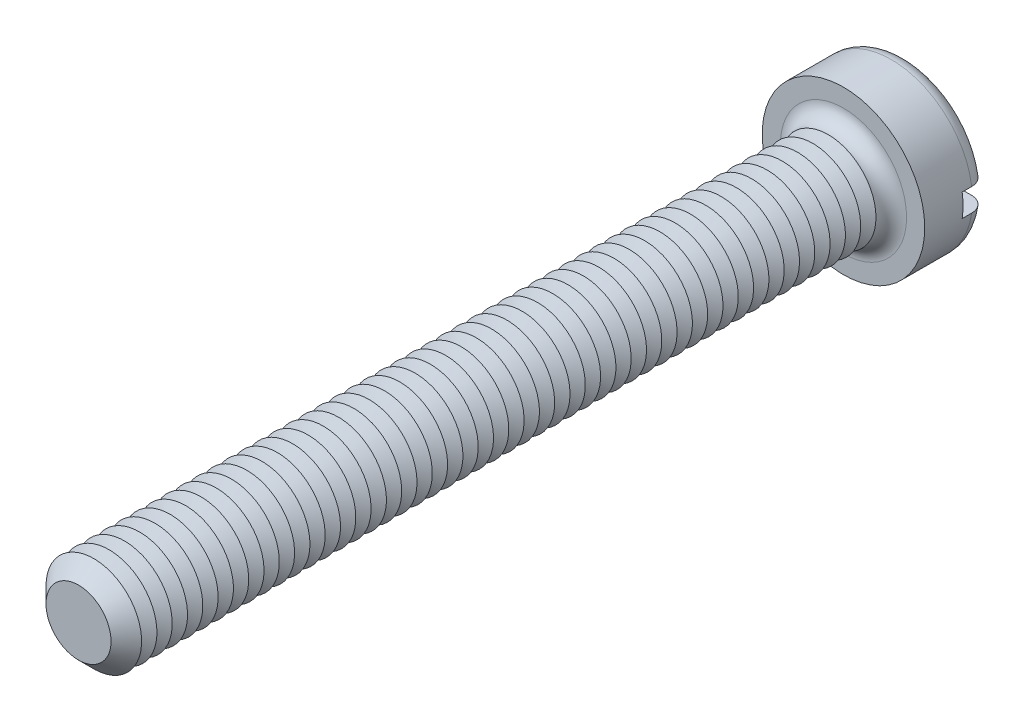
ISO-10303-21;
HEADER;
FILE_DESCRIPTION(('STEP AP214'),'2;1');
FILE_NAME('part.step','',(''),(''),'','','');
FILE_SCHEMA(('AUTOMOTIVE_DESIGN { 1 0 10303 214 1 1 1 1 }'));
ENDSEC;
DATA;
#1=APPLICATION_CONTEXT('core data for automotive mechanical design processes');
#2=APPLICATION_PROTOCOL_DEFINITION('international standard','automotive_design',2000,#1);
#3=PRODUCT_CONTEXT('',#1,'mechanical');
#4=PRODUCT('Part','Part','',(#3));
#5=PRODUCT_RELATED_PRODUCT_CATEGORY('part','',(#4));
#6=PRODUCT_DEFINITION_FORMATION('','',#4);
#7=PRODUCT_DEFINITION_CONTEXT('part definition',#1,'design');
#8=PRODUCT_DEFINITION('design','',#6,#7);
#9=PRODUCT_DEFINITION_SHAPE('','',#8);
#10=(LENGTH_UNIT() NAMED_UNIT(*) SI_UNIT(.MILLI.,.METRE.));
#11=(NAMED_UNIT(*) PLANE_ANGLE_UNIT() SI_UNIT($,.RADIAN.));
#12=(NAMED_UNIT(*) SI_UNIT($,.STERADIAN.) SOLID_ANGLE_UNIT());
#13=UNCERTAINTY_MEASURE_WITH_UNIT(LENGTH_MEASURE(1.E-05),#10,'distance_accuracy_value','');
#14=(GEOMETRIC_REPRESENTATION_CONTEXT(3) GLOBAL_UNCERTAINTY_ASSIGNED_CONTEXT((#13)) GLOBAL_UNIT_ASSIGNED_CONTEXT((#10,
#11,#12)) REPRESENTATION_CONTEXT('',''));
#15=CARTESIAN_POINT('',(0.,0.,0.));
#16=DIRECTION('',(0.,0.,1.));
#17=DIRECTION('',(1.,0.,0.));
#18=AXIS2_PLACEMENT_3D('',#15,#16,#17);
#19=CARTESIAN_POINT('',(0.,0.,-3.3));
#20=DIRECTION('',(0.,0.,1.));
#21=DIRECTION('',(1.,0.,0.));
#22=AXIS2_PLACEMENT_3D('',#19,#20,#21);
#23=PLANE('',#22);
#24=CARTESIAN_POINT('',(0.,0.,-3.3));
#25=DIRECTION('',(0.,0.,1.));
#26=DIRECTION('',(1.,0.,0.));
#27=AXIS2_PLACEMENT_3D('',#24,#25,#26);
#28=CIRCLE('',#27,3.45);
#29=CARTESIAN_POINT('',(-3.39742549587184,0.6,-3.3));
#30=VERTEX_POINT('',#29);
#31=CARTESIAN_POINT('',(3.39742549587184,0.6,-3.3));
#32=VERTEX_POINT('',#31);
#33=EDGE_CURVE('E116',#30,#32,#28,.F.);
#34=ORIENTED_EDGE('',*,*,#33,.T.);
#35=DIRECTION('',(1.,0.,0.));
#36=VECTOR('',#35,1.);
#37=CARTESIAN_POINT('',(-4.25,0.600000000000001,-3.3));
#38=LINE('',#37,#36);
#39=EDGE_CURVE('E111',#30,#32,#38,.T.);
#40=ORIENTED_EDGE('',*,*,#39,.F.);
#41=EDGE_LOOP('',(#34,#40));
#42=FACE_BOUND('',#41,.T.);
#43=ADVANCED_FACE('F39',(#42),#23,.F.);
#44=CARTESIAN_POINT('',(0.,0.,-2.5));
#45=DIRECTION('',(0.,0.,1.));
#46=DIRECTION('',(1.,0.,0.));
#47=AXIS2_PLACEMENT_3D('',#44,#45,#46);
#48=TOROIDAL_SURFACE('',#47,3.45,0.8);
#49=CARTESIAN_POINT('',(-4.06369072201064,0.600000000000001,-2.95537828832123));
#50=CARTESIAN_POINT('',(-4.03774340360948,0.600000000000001,-2.99245078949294));
#51=CARTESIAN_POINT('',(-4.00861849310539,0.600000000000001,-3.02734231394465));
#52=CARTESIAN_POINT('',(-3.94488199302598,0.600000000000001,-3.0917502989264));
#53=CARTESIAN_POINT('',(-3.91026320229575,0.600000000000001,-3.12125959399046));
#54=CARTESIAN_POINT('',(-3.83660561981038,0.600000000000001,-3.17403695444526));
#55=CARTESIAN_POINT('',(-3.79757117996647,0.6,-3.19731109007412));
#56=CARTESIAN_POINT('',(-3.71618817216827,0.6,-3.23703443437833));
#57=CARTESIAN_POINT('',(-3.67384041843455,0.6,-3.25348531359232));
#58=CARTESIAN_POINT('',(-3.58661930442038,0.6,-3.2792758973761));
#59=CARTESIAN_POINT('',(-3.54172669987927,0.6,-3.288550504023));
#60=CARTESIAN_POINT('',(-3.45102322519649,0.6,-3.29952632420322));
#61=CARTESIAN_POINT('',(-3.40521225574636,0.6,-3.30122671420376));
#62=CARTESIAN_POINT('',(-3.31340831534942,0.6,-3.29701196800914));
#63=CARTESIAN_POINT('',(-3.26741940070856,0.6,-3.29100823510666));
#64=CARTESIAN_POINT('',(-3.17708556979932,0.6,-3.27141469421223));
#65=CARTESIAN_POINT('',(-3.13274074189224,0.6,-3.25782447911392));
#66=CARTESIAN_POINT('',(-3.0466814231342,0.6,-3.22332549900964));
#67=CARTESIAN_POINT('',(-3.00498444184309,0.6,-3.20237301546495));
#68=CARTESIAN_POINT('',(-2.92572251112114,0.6,-3.15372961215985));
#69=CARTESIAN_POINT('',(-2.88815755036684,0.6,-3.12603871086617));
#70=CARTESIAN_POINT('',(-2.81847654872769,0.6,-3.06483322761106));
#71=CARTESIAN_POINT('',(-2.78633186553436,0.6,-3.03135128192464));
#72=CARTESIAN_POINT('',(-2.72824805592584,0.6,-2.95937651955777));
#73=CARTESIAN_POINT('',(-2.70230829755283,0.6,-2.92088421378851));
#74=CARTESIAN_POINT('',(-2.65791262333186,0.6,-2.84074227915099));
#75=CARTESIAN_POINT('',(-2.63932560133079,0.6,-2.79916531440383));
#76=CARTESIAN_POINT('',(-2.60958432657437,0.6,-2.7134333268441));
#77=CARTESIAN_POINT('',(-2.59842889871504,0.6,-2.66927871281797));
#78=CARTESIAN_POINT('',(-2.58411140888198,0.6,-2.58073966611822));
#79=CARTESIAN_POINT('',(-2.58077086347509,0.6,-2.5363840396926));
#80=CARTESIAN_POINT('',(-2.58167367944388,0.6,-2.44775208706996));
#81=CARTESIAN_POINT('',(-2.58591644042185,0.6,-2.40347575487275));
#82=CARTESIAN_POINT('',(-2.60175154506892,0.6,-2.31675105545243));
#83=CARTESIAN_POINT('',(-2.61326489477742,0.6,-2.27428821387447));
#84=CARTESIAN_POINT('',(-2.6431863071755,0.6,-2.19186794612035));
#85=CARTESIAN_POINT('',(-2.66159465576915,0.6,-2.15191062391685));
#86=CARTESIAN_POINT('',(-2.70494650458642,0.6,-2.07517696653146));
#87=CARTESIAN_POINT('',(-2.72995486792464,0.6,-2.03843731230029));
#88=CARTESIAN_POINT('',(-2.7856570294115,0.6,-1.96955746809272));
#89=CARTESIAN_POINT('',(-2.81635145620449,0.6,-1.93741778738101));
#90=CARTESIAN_POINT('',(-2.88329572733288,0.6,-1.87788048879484));
#91=CARTESIAN_POINT('',(-2.91965530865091,0.6,-1.85060625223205));
#92=CARTESIAN_POINT('',(-2.9963658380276,0.6,-1.80241044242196));
#93=CARTESIAN_POINT('',(-3.03671721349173,0.6,-1.78148955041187));
#94=CARTESIAN_POINT('',(-3.12111125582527,0.6,-1.74619829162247));
#95=CARTESIAN_POINT('',(-3.16521020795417,0.6,-1.73196239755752));
#96=CARTESIAN_POINT('',(-3.25516487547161,0.6,-1.71103773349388));
#97=CARTESIAN_POINT('',(-3.30102068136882,0.6,-1.70434935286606));
#98=CARTESIAN_POINT('',(-3.39352689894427,0.6,-1.69870104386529));
#99=CARTESIAN_POINT('',(-3.44018061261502,0.6,-1.69979487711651));
#100=CARTESIAN_POINT('',(-3.53263583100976,0.6,-1.70983959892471));
#101=CARTESIAN_POINT('',(-3.57843734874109,0.6,-1.71879036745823));
#102=CARTESIAN_POINT('',(-3.66763544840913,0.6,-1.74426972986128));
#103=CARTESIAN_POINT('',(-3.71104292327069,0.6,-1.76076015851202));
#104=CARTESIAN_POINT('',(-3.79442616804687,0.6,-1.80087686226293));
#105=CARTESIAN_POINT('',(-3.83440212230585,0.600000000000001,-1.82450275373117));
#106=CARTESIAN_POINT('',(-3.90929765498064,0.600000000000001,-1.87793548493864));
#107=CARTESIAN_POINT('',(-3.94426963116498,0.600000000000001,-1.90766887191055));
#108=CARTESIAN_POINT('',(-4.00864839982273,0.600000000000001,-1.9726503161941));
#109=CARTESIAN_POINT('',(-4.03805555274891,0.600000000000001,-2.00789801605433));
#110=CARTESIAN_POINT('',(-4.09009460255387,0.600000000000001,-2.08244463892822));
#111=CARTESIAN_POINT('',(-4.11280448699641,0.600000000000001,-2.12168912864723));
#112=CARTESIAN_POINT('',(-4.15124086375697,0.600000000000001,-2.2034588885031));
#113=CARTESIAN_POINT('',(-4.16696802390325,0.600000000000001,-2.24598384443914));
#114=CARTESIAN_POINT('',(-4.19085131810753,0.600000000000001,-2.33267862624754));
#115=CARTESIAN_POINT('',(-4.19907708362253,0.600000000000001,-2.37682928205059));
#116=CARTESIAN_POINT('',(-4.2079638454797,0.600000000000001,-2.46589754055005));
#117=CARTESIAN_POINT('',(-4.20862315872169,0.600000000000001,-2.51081531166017));
#118=CARTESIAN_POINT('',(-4.20236829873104,0.600000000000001,-2.59993343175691));
#119=CARTESIAN_POINT('',(-4.19548454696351,0.600000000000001,-2.64413593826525));
#120=CARTESIAN_POINT('',(-4.17439924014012,0.600000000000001,-2.73071930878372));
#121=CARTESIAN_POINT('',(-4.16020675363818,0.600000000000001,-2.77310235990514));
#122=CARTESIAN_POINT('',(-4.1318825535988,0.600000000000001,-2.83880495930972));
#123=CARTESIAN_POINT('',(-4.11991183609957,0.600000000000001,-2.86307959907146));
#124=CARTESIAN_POINT('',(-4.09356927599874,0.600000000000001,-2.91028856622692));
#125=CARTESIAN_POINT('',(-4.07919744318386,0.600000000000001,-2.9332228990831));
#126=CARTESIAN_POINT('',(-4.06369072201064,0.600000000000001,-2.95537828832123));
#127=B_SPLINE_CURVE_WITH_KNOTS('',3,(#49,#50,#51,#52,#53,#54,#55,#56,#57,#58,#59,#60,#61,#62,
#63,#64,#65,#66,#67,#68,#69,#70,#71,#72,#73,#74,#75,#76,#77,#78,#79,#80,#81,#82,#83,#84,#85,#86,
#87,#88,#89,#90,#91,#92,#93,#94,#95,#96,#97,#98,#99,#100,#101,#102,#103,#104,#105,#106,#107,
#108,#109,#110,#111,#112,#113,#114,#115,#116,#117,#118,#119,#120,#121,#122,#123,#124,#125,#126),
.UNSPECIFIED.,.T.,.F.,(4,2,2,2,2,2,2,2,2,2,2,2,2,2,2,2,2,2,2,2,2,2,2,2,2,2,2,2,2,2,2,2,2,2,2,2,
2,2,4),(0.,0.13565225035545,0.271483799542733,0.407182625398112,0.542848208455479,
0.679730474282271,0.816627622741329,0.955113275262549,1.09360635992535,1.23293614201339,
1.37226554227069,1.51083389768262,1.64938813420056,1.78534653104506,1.92128342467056,
2.0540840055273,2.18687407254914,2.31824564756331,2.44962267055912,2.58234229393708,
2.71507659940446,2.85080630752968,2.98655056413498,3.12491938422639,3.26329534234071,
3.40262816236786,3.54195885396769,3.68059194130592,3.81921757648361,3.95626453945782,
4.09330262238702,4.2286754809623,4.36403538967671,4.49812564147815,4.63224572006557,
4.76582687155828,4.89924267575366,4.98031194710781,5.0613808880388),.UNSPECIFIED.);
#128=CARTESIAN_POINT('',(-4.20743389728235,0.600000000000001,-2.50000000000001));
#129=VERTEX_POINT('',#128);
#130=EDGE_CURVE('E563',#129,#30,#127,.T.);
#131=ORIENTED_EDGE('',*,*,#130,.F.);
#132=CARTESIAN_POINT('',(0.,0.,-2.5));
#133=DIRECTION('',(0.,0.,1.));
#134=DIRECTION('',(1.,0.,0.));
#135=AXIS2_PLACEMENT_3D('',#132,#133,#134);
#136=CIRCLE('',#135,4.25);
#137=CARTESIAN_POINT('',(4.20743389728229,0.599999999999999,-2.5));
#138=VERTEX_POINT('',#137);
#139=EDGE_CURVE('E125',#138,#129,#136,.T.);
#140=ORIENTED_EDGE('',*,*,#139,.F.);
#141=CARTESIAN_POINT('',(2.63947327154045,0.6,-2.79608831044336));
#142=CARTESIAN_POINT('',(2.65655980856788,0.6,-2.83790320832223));
#143=CARTESIAN_POINT('',(2.67725642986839,0.6,-2.87828303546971));
#144=CARTESIAN_POINT('',(2.72519250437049,0.6,-2.95500233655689));
#145=CARTESIAN_POINT('',(2.75244152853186,0.6,-2.9913357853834));
#146=CARTESIAN_POINT('',(2.81257938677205,0.6,-3.05889430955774));
#147=CARTESIAN_POINT('',(2.84545995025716,0.6,-3.09012674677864));
#148=CARTESIAN_POINT('',(2.91591143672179,0.6,-3.14672620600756));
#149=CARTESIAN_POINT('',(2.95348119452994,0.6,-3.17209468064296));
#150=CARTESIAN_POINT('',(3.03291143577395,0.6,-3.21669611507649));
#151=CARTESIAN_POINT('',(3.07483186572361,0.6,-3.23582234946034));
#152=CARTESIAN_POINT('',(3.16126659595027,0.6,-3.26686062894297));
#153=CARTESIAN_POINT('',(3.2057811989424,0.6,-3.27877183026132));
#154=CARTESIAN_POINT('',(3.29669878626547,0.6,-3.29514603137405));
#155=CARTESIAN_POINT('',(3.34311773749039,0.6,-3.29952056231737));
#156=CARTESIAN_POINT('',(3.43603189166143,0.6,-3.30040472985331));
#157=CARTESIAN_POINT('',(3.48252709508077,0.6,-3.29691431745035));
#158=CARTESIAN_POINT('',(3.57420049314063,0.6,-3.28214240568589));
#159=CARTESIAN_POINT('',(3.61938038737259,0.6,-3.27087147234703));
#160=CARTESIAN_POINT('',(3.70717477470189,0.6,-3.24082890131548));
#161=CARTESIAN_POINT('',(3.74978938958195,0.6,-3.22205762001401));
#162=CARTESIAN_POINT('',(3.83078828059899,0.6,-3.17773607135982));
#163=CARTESIAN_POINT('',(3.86921015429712,0.599999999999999,-3.15225453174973));
#164=CARTESIAN_POINT('',(3.94116038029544,0.599999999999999,-3.09512672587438));
#165=CARTESIAN_POINT('',(3.9746890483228,0.599999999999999,-3.06348085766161));
#166=CARTESIAN_POINT('',(4.03545911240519,0.599999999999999,-2.99534640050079));
#167=CARTESIAN_POINT('',(4.06277344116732,0.599999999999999,-2.95892285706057));
#168=CARTESIAN_POINT('',(4.11082191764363,0.599999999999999,-2.88196698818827));
#169=CARTESIAN_POINT('',(4.13155647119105,0.599999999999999,-2.84143491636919));
#170=CARTESIAN_POINT('',(4.16563480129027,0.599999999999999,-2.75787550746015));
#171=CARTESIAN_POINT('',(4.1790544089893,0.599999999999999,-2.71487908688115));
#172=CARTESIAN_POINT('',(4.19843340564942,0.599999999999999,-2.62723691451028));
#173=CARTESIAN_POINT('',(4.20439310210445,0.599999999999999,-2.58259123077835));
#174=CARTESIAN_POINT('',(4.2086595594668,0.599999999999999,-2.49321831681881));
#175=CARTESIAN_POINT('',(4.20701422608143,0.599999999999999,-2.4484933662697));
#176=CARTESIAN_POINT('',(4.1962295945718,0.599999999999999,-2.35995704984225));
#177=CARTESIAN_POINT('',(4.18709040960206,0.599999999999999,-2.31614567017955));
#178=CARTESIAN_POINT('',(4.16160290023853,0.599999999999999,-2.23072100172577));
#179=CARTESIAN_POINT('',(4.14526169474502,0.599999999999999,-2.18910558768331));
#180=CARTESIAN_POINT('',(4.10585410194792,0.599999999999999,-2.10919238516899));
#181=CARTESIAN_POINT('',(4.08278762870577,0.599999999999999,-2.07089463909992));
#182=CARTESIAN_POINT('',(4.030487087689,0.599999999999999,-1.99851484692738));
#183=CARTESIAN_POINT('',(4.00122628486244,0.599999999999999,-1.9644521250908));
#184=CARTESIAN_POINT('',(3.93744772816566,0.599999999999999,-1.90166877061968));
#185=CARTESIAN_POINT('',(3.90292977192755,0.599999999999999,-1.87294834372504));
#186=CARTESIAN_POINT('',(3.82928727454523,0.599999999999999,-1.82137853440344));
#187=CARTESIAN_POINT('',(3.79012374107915,0.6,-1.79858484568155));
#188=CARTESIAN_POINT('',(3.70856025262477,0.6,-1.75980712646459));
#189=CARTESIAN_POINT('',(3.66616010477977,0.6,-1.74382350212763));
#190=CARTESIAN_POINT('',(3.57878495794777,0.6,-1.71891499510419));
#191=CARTESIAN_POINT('',(3.53378519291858,0.6,-1.71007699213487));
#192=CARTESIAN_POINT('',(3.44294322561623,0.6,-1.69998722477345));
#193=CARTESIAN_POINT('',(3.3971009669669,0.6,-1.69873596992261));
#194=CARTESIAN_POINT('',(3.30531297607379,0.6,-1.70385439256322));
#195=CARTESIAN_POINT('',(3.25937213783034,0.6,-1.71031204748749));
#196=CARTESIAN_POINT('',(3.1692099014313,0.6,-1.73080107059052));
#197=CARTESIAN_POINT('',(3.12498860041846,0.6,-1.74483286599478));
#198=CARTESIAN_POINT('',(3.03926209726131,0.6,-1.78018941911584));
#199=CARTESIAN_POINT('',(2.99777407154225,0.6,-1.80155586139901));
#200=CARTESIAN_POINT('',(2.91899881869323,0.6,-1.85098881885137));
#201=CARTESIAN_POINT('',(2.88171158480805,0.6,-1.8790553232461));
#202=CARTESIAN_POINT('',(2.81266124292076,0.6,-1.94094884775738));
#203=CARTESIAN_POINT('',(2.78086710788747,0.6,-1.97474122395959));
#204=CARTESIAN_POINT('',(2.72353615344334,0.6,-2.0472724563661));
#205=CARTESIAN_POINT('',(2.69799841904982,0.6,-2.08601058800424));
#206=CARTESIAN_POINT('',(2.65444718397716,0.6,-2.16655019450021));
#207=CARTESIAN_POINT('',(2.63629889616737,0.6,-2.20827875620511));
#208=CARTESIAN_POINT('',(2.60744942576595,0.6,-2.29424821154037));
#209=CARTESIAN_POINT('',(2.59674901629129,0.6,-2.33848936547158));
#210=CARTESIAN_POINT('',(2.5833312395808,0.6,-2.42714258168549));
#211=CARTESIAN_POINT('',(2.58043995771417,0.6,-2.47152848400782));
#212=CARTESIAN_POINT('',(2.58224493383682,0.6,-2.56010574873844));
#213=CARTESIAN_POINT('',(2.58693104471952,0.6,-2.60429729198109));
#214=CARTESIAN_POINT('',(2.60020046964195,0.6,-2.67311978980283));
#215=CARTESIAN_POINT('',(2.60635343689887,0.6,-2.69824441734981));
#216=CARTESIAN_POINT('',(2.62110140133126,0.6,-2.74776540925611));
#217=CARTESIAN_POINT('',(2.62969634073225,0.6,-2.77216179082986));
#218=CARTESIAN_POINT('',(2.63947327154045,0.6,-2.79608831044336));
#219=B_SPLINE_CURVE_WITH_KNOTS('',3,(#141,#142,#143,#144,#145,#146,#147,#148,#149,#150,#151,
#152,#153,#154,#155,#156,#157,#158,#159,#160,#161,#162,#163,#164,#165,#166,#167,#168,#169,#170,
#171,#172,#173,#174,#175,#176,#177,#178,#179,#180,#181,#182,#183,#184,#185,#186,#187,#188,#189,
#190,#191,#192,#193,#194,#195,#196,#197,#198,#199,#200,#201,#202,#203,#204,#205,#206,#207,#208,
#209,#210,#211,#212,#213,#214,#215,#216,#217,#218),.UNSPECIFIED.,.T.,.F.,(4,2,2,2,2,2,2,2,2,2,2,
2,2,2,2,2,2,2,2,2,2,2,2,2,2,2,2,2,2,2,2,2,2,2,2,2,2,2,4),(0.,0.135416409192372,
0.271031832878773,0.406449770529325,0.541834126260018,0.679424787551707,0.817031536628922,
0.956242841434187,1.09545501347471,1.23447850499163,1.37349539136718,1.51114036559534,
1.64877645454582,1.78470267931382,1.92062051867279,2.05510117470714,2.1895762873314,
2.32320547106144,2.45683263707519,2.59032801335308,2.72382509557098,2.85791055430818,
2.99200117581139,3.12730969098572,3.26262627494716,3.39956435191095,3.53651162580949,
3.67503685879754,3.81356990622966,3.95290367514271,4.09223721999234,4.23075602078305,
4.36925455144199,4.50509949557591,4.6409585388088,4.77376594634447,4.90639565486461,
4.98388287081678,5.06136825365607),.UNSPECIFIED.);
#220=EDGE_CURVE('E565',#32,#138,#219,.T.);
#221=ORIENTED_EDGE('',*,*,#220,.F.);
#222=ORIENTED_EDGE('',*,*,#33,.F.);
#223=EDGE_LOOP('',(#131,#140,#221,#222));
#224=FACE_BOUND('',#223,.T.);
#225=ADVANCED_FACE('F547',(#224),#48,.T.);
#226=CARTESIAN_POINT('',(0.,0.,-3.3));
#227=DIRECTION('',(0.,0.,1.));
#228=DIRECTION('',(1.,0.,0.));
#229=AXIS2_PLACEMENT_3D('',#226,#227,#228);
#230=CYLINDRICAL_SURFACE('',#229,4.25);
#231=DIRECTION('',(0.,0.,1.));
#232=VECTOR('',#231,1.);
#233=CARTESIAN_POINT('',(4.20743389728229,0.599999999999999,-3.3));
#234=LINE('',#233,#232);
#235=CARTESIAN_POINT('',(4.20743389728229,0.599999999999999,-2.));
#236=VERTEX_POINT('',#235);
#237=EDGE_CURVE('E581',#138,#236,#234,.T.);
#238=ORIENTED_EDGE('',*,*,#237,.F.);
#239=ORIENTED_EDGE('',*,*,#139,.T.);
#240=DIRECTION('',(0.,0.,1.));
#241=VECTOR('',#240,1.);
#242=CARTESIAN_POINT('',(-4.20743389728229,0.600000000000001,-3.3));
#243=LINE('',#242,#241);
#244=CARTESIAN_POINT('',(-4.20743389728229,0.600000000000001,-2.));
#245=VERTEX_POINT('',#244);
#246=EDGE_CURVE('E63',#245,#129,#243,.F.);
#247=ORIENTED_EDGE('',*,*,#246,.F.);
#248=CARTESIAN_POINT('',(0.,0.,-2.));
#249=DIRECTION('',(0.,0.,-1.));
#250=DIRECTION('',(-1.,0.,0.));
#251=AXIS2_PLACEMENT_3D('',#248,#249,#250);
#252=CIRCLE('',#251,4.25);
#253=CARTESIAN_POINT('',(-4.20743389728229,-0.599999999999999,-2.));
#254=VERTEX_POINT('',#253);
#255=EDGE_CURVE('E43',#245,#254,#252,.F.);
#256=ORIENTED_EDGE('',*,*,#255,.T.);
#257=DIRECTION('',(0.,0.,1.));
#258=VECTOR('',#257,1.);
#259=CARTESIAN_POINT('',(-4.20743389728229,-0.599999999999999,-3.3));
#260=LINE('',#259,#258);
#261=CARTESIAN_POINT('',(-4.20743389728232,-0.599999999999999,-2.5));
#262=VERTEX_POINT('',#261);
#263=EDGE_CURVE('E578',#262,#254,#260,.T.);
#264=ORIENTED_EDGE('',*,*,#263,.F.);
#265=CARTESIAN_POINT('',(4.20743389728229,-0.600000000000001,-2.5));
#266=VERTEX_POINT('',#265);
#267=EDGE_CURVE('E127',#262,#266,#136,.T.);
#268=ORIENTED_EDGE('',*,*,#267,.T.);
#269=DIRECTION('',(0.,0.,1.));
#270=VECTOR('',#269,1.);
#271=CARTESIAN_POINT('',(4.20743389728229,-0.600000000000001,-3.3));
#272=LINE('',#271,#270);
#273=CARTESIAN_POINT('',(4.20743389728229,-0.600000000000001,-2.));
#274=VERTEX_POINT('',#273);
#275=EDGE_CURVE('E55',#274,#266,#272,.F.);
#276=ORIENTED_EDGE('',*,*,#275,.F.);
#277=EDGE_CURVE('E11',#274,#236,#252,.F.);
#278=ORIENTED_EDGE('',*,*,#277,.T.);
#279=EDGE_LOOP('',(#238,#239,#247,#256,#264,#268,#276,#278));
#280=FACE_BOUND('',#279,.T.);
#281=CARTESIAN_POINT('',(0.,0.,0.));
#282=DIRECTION('',(0.,0.,1.));
#283=DIRECTION('',(1.,0.,0.));
#284=AXIS2_PLACEMENT_3D('',#281,#282,#283);
#285=CIRCLE('',#284,4.25);
#286=CARTESIAN_POINT('',(4.25,0.,0.));
#287=VERTEX_POINT('',#286);
#288=EDGE_CURVE('E584',#287,#287,#285,.T.);
#289=ORIENTED_EDGE('',*,*,#288,.F.);
#290=EDGE_LOOP('',(#289));
#291=FACE_BOUND('',#290,.T.);
#292=ADVANCED_FACE('F543',(#280,#291),#230,.T.);
#293=CARTESIAN_POINT('',(3.39742549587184,-0.6,-3.3));
#294=VERTEX_POINT('',#293);
#295=CARTESIAN_POINT('',(-3.39742549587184,-0.6,-3.3));
#296=VERTEX_POINT('',#295);
#297=EDGE_CURVE('E109',#294,#296,#28,.F.);
#298=ORIENTED_EDGE('',*,*,#297,.T.);
#299=DIRECTION('',(-1.,0.,0.));
#300=VECTOR('',#299,1.);
#301=CARTESIAN_POINT('',(-4.25,-0.599999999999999,-3.3));
#302=LINE('',#301,#300);
#303=EDGE_CURVE('E96',#294,#296,#302,.T.);
#304=ORIENTED_EDGE('',*,*,#303,.F.);
#305=EDGE_LOOP('',(#298,#304));
#306=FACE_BOUND('',#305,.T.);
#307=ADVANCED_FACE('F108',(#306),#23,.F.);
#308=CARTESIAN_POINT('',(0.,0.,0.));
#309=DIRECTION('',(0.,0.,1.));
#310=DIRECTION('',(1.,0.,0.));
#311=AXIS2_PLACEMENT_3D('',#308,#309,#310);
#312=PLANE('',#311);
#313=CARTESIAN_POINT('',(0.,0.,0.));
#314=DIRECTION('',(0.,0.,1.));
#315=DIRECTION('',(1.,0.,0.));
#316=AXIS2_PLACEMENT_3D('',#313,#314,#315);
#317=CIRCLE('',#316,3.3);
#318=CARTESIAN_POINT('',(3.3,0.,0.));
#319=VERTEX_POINT('',#318);
#320=EDGE_CURVE('E115',#319,#319,#317,.F.);
#321=ORIENTED_EDGE('',*,*,#320,.T.);
#322=EDGE_LOOP('',(#321));
#323=FACE_BOUND('',#322,.T.);
#324=ORIENTED_EDGE('',*,*,#288,.T.);
#325=EDGE_LOOP('',(#324));
#326=FACE_BOUND('',#325,.T.);
#327=ADVANCED_FACE('F542',(#323,#326),#312,.T.);
#328=CARTESIAN_POINT('',(-4.06369072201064,-0.599999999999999,-2.95537828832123));
#329=CARTESIAN_POINT('',(-4.08928577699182,-0.599999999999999,-2.91880204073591));
#330=CARTESIAN_POINT('',(-4.11182555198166,-0.599999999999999,-2.88005030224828));
#331=CARTESIAN_POINT('',(-4.15010404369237,-0.599999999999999,-2.79928452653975));
#332=CARTESIAN_POINT('',(-4.16583526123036,-0.599999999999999,-2.75726695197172));
#333=CARTESIAN_POINT('',(-4.19000286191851,-0.599999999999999,-2.67118996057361));
#334=CARTESIAN_POINT('',(-4.19844101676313,-0.599999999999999,-2.62713104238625));
#335=CARTESIAN_POINT('',(-4.20777174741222,-0.599999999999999,-2.53823222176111));
#336=CARTESIAN_POINT('',(-4.20866608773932,-0.599999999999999,-2.49339250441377));
#337=CARTESIAN_POINT('',(-4.20289683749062,-0.599999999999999,-2.40433856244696));
#338=CARTESIAN_POINT('',(-4.19625607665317,-0.599999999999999,-2.36012285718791));
#339=CARTESIAN_POINT('',(-4.17565084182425,-0.599999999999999,-2.27343166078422));
#340=CARTESIAN_POINT('',(-4.16168615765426,-0.599999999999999,-2.23095621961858));
#341=CARTESIAN_POINT('',(-4.12683188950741,-0.599999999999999,-2.14890863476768));
#342=CARTESIAN_POINT('',(-4.10593663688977,-0.599999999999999,-2.10933890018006));
#343=CARTESIAN_POINT('',(-4.05783763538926,-0.599999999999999,-2.03424145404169));
#344=CARTESIAN_POINT('',(-4.03063375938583,-0.599999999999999,-1.99871382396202));
#345=CARTESIAN_POINT('',(-3.97052236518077,-0.599999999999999,-1.93246905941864));
#346=CARTESIAN_POINT('',(-3.93758114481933,-0.599999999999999,-1.90178251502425));
#347=CARTESIAN_POINT('',(-3.86706007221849,-0.599999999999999,-1.84630837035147));
#348=CARTESIAN_POINT('',(-3.82948001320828,-0.6,-1.82152103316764));
#349=CARTESIAN_POINT('',(-3.75033766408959,-0.6,-1.77826995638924));
#350=CARTESIAN_POINT('',(-3.70873831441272,-0.6,-1.7598740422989));
#351=CARTESIAN_POINT('',(-3.62306661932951,-0.6,-1.73023196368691));
#352=CARTESIAN_POINT('',(-3.57899411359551,-0.6,-1.71898626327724));
#353=CARTESIAN_POINT('',(-3.48904845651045,-0.6,-1.70382025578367));
#354=CARTESIAN_POINT('',(-3.44315982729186,-0.6,-1.69999172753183));
#355=CARTESIAN_POINT('',(-3.35138360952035,-0.6,-1.7000083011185));
#356=CARTESIAN_POINT('',(-3.30549602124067,-0.6,-1.70385391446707));
#357=CARTESIAN_POINT('',(-3.21452492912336,-0.6,-1.71917227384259));
#358=CARTESIAN_POINT('',(-3.16945455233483,-0.6,-1.73072307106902));
#359=CARTESIAN_POINT('',(-3.08188104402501,-0.6,-1.76120640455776));
#360=CARTESIAN_POINT('',(-3.0393780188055,-0.6,-1.78013924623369));
#361=CARTESIAN_POINT('',(-2.95805296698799,-0.6,-1.82493384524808));
#362=CARTESIAN_POINT('',(-2.9192403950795,-0.6,-1.85081278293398));
#363=CARTESIAN_POINT('',(-2.84656695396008,-0.6,-1.90878317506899));
#364=CARTESIAN_POINT('',(-2.81270591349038,-0.6,-1.94087441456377));
#365=CARTESIAN_POINT('',(-2.75131050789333,-0.6,-2.01002500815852));
#366=CARTESIAN_POINT('',(-2.72371339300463,-0.6,-2.04702860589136));
#367=CARTESIAN_POINT('',(-2.67528742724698,-0.6,-2.12522869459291));
#368=CARTESIAN_POINT('',(-2.65445765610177,-0.6,-2.1664246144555));
#369=CARTESIAN_POINT('',(-2.62065354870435,-0.6,-2.25087266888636));
#370=CARTESIAN_POINT('',(-2.60751663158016,-0.6,-2.29405971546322));
#371=CARTESIAN_POINT('',(-2.58885106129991,-0.6,-2.38204659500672));
#372=CARTESIAN_POINT('',(-2.58332131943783,-0.6,-2.42684619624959));
#373=CARTESIAN_POINT('',(-2.58009777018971,-0.6,-2.51580379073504));
#374=CARTESIAN_POINT('',(-2.58224575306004,-0.6,-2.55995612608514));
#375=CARTESIAN_POINT('',(-2.59395205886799,-0.6,-2.64726495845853));
#376=CARTESIAN_POINT('',(-2.60351013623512,-0.6,-2.69042148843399));
#377=CARTESIAN_POINT('',(-2.62967159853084,-0.6,-2.77438771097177));
#378=CARTESIAN_POINT('',(-2.64625243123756,-0.6,-2.81520444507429));
#379=CARTESIAN_POINT('',(-2.68592348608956,-0.6,-2.89353901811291));
#380=CARTESIAN_POINT('',(-2.70901418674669,-0.6,-2.9310566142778));
#381=CARTESIAN_POINT('',(-2.7614318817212,-0.6,-3.00240040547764));
#382=CARTESIAN_POINT('',(-2.79085487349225,-0.6,-3.03615603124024));
#383=CARTESIAN_POINT('',(-2.85483456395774,-0.6,-3.09838834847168));
#384=CARTESIAN_POINT('',(-2.88939187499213,-0.6,-3.12686440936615));
#385=CARTESIAN_POINT('',(-2.96351967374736,-0.6,-3.17841283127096));
#386=CARTESIAN_POINT('',(-3.00318741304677,-0.6,-3.20134539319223));
#387=CARTESIAN_POINT('',(-3.08576649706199,-0.6,-3.24034364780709));
#388=CARTESIAN_POINT('',(-3.12867814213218,-0.6,-3.25640870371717));
#389=CARTESIAN_POINT('',(-3.21724048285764,-0.6,-3.28143816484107));
#390=CARTESIAN_POINT('',(-3.26292314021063,-0.6,-3.29028963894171));
#391=CARTESIAN_POINT('',(-3.35512527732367,-0.6,-3.30021681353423));
#392=CARTESIAN_POINT('',(-3.40164474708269,-0.6,-3.30129260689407));
#393=CARTESIAN_POINT('',(-3.49429978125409,-0.6,-3.29560589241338));
#394=CARTESIAN_POINT('',(-3.54043436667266,-0.6,-3.28882735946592));
#395=CARTESIAN_POINT('',(-3.63090382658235,-0.6,-3.26755492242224));
#396=CARTESIAN_POINT('',(-3.67523831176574,-0.6,-3.25305935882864));
#397=CARTESIAN_POINT('',(-3.76046509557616,-0.6,-3.21686867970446));
#398=CARTESIAN_POINT('',(-3.80138087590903,-0.599999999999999,-3.1952288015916));
#399=CARTESIAN_POINT('',(-3.8788986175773,-0.599999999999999,-3.14531817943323));
#400=CARTESIAN_POINT('',(-3.91550599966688,-0.599999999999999,-3.11705590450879));
#401=CARTESIAN_POINT('',(-3.97074313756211,-0.599999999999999,-3.06628809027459));
#402=CARTESIAN_POINT('',(-3.99100743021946,-0.599999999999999,-3.04553102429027));
#403=CARTESIAN_POINT('',(-4.02917385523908,-0.599999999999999,-3.00194762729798));
#404=CARTESIAN_POINT('',(-4.04707600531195,-0.599999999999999,-2.97912131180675));
#405=CARTESIAN_POINT('',(-4.06369072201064,-0.599999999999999,-2.95537828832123));
#406=B_SPLINE_CURVE_WITH_KNOTS('',3,(#328,#329,#330,#331,#332,#333,#334,#335,#336,#337,#338,
#339,#340,#341,#342,#343,#344,#345,#346,#347,#348,#349,#350,#351,#352,#353,#354,#355,#356,#357,
#358,#359,#360,#361,#362,#363,#364,#365,#366,#367,#368,#369,#370,#371,#372,#373,#374,#375,#376,
#377,#378,#379,#380,#381,#382,#383,#384,#385,#386,#387,#388,#389,#390,#391,#392,#393,#394,#395,
#396,#397,#398,#399,#400,#401,#402,#403,#404,#405),.UNSPECIFIED.,.T.,.F.,(4,2,2,2,2,2,2,2,2,2,2,
2,2,2,2,2,2,2,2,2,2,2,2,2,2,2,2,2,2,2,2,2,2,2,2,2,2,2,4),(0.,0.133821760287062,
0.267790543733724,0.401726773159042,0.535631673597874,0.669131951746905,0.802636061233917,
0.936249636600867,1.06986590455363,1.2042952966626,1.3387306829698,1.47455198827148,
1.61038210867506,1.74788249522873,1.88539204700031,2.02431612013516,2.16324594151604,
2.30252260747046,2.4417944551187,2.57960263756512,2.71739207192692,2.85215325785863,
2.98689515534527,3.11887666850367,3.25085380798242,3.38241030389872,3.51397647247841,
3.64769871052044,3.78143690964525,3.91826005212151,4.05509587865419,4.19403485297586,
4.33297216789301,4.47219345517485,4.61144469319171,4.74964356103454,4.887666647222,
4.97453605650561,5.06140481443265),.UNSPECIFIED.);
#407=EDGE_CURVE('E103',#296,#262,#406,.T.);
#408=ORIENTED_EDGE('',*,*,#407,.F.);
#409=ORIENTED_EDGE('',*,*,#297,.F.);
#410=CARTESIAN_POINT('',(2.63947327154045,-0.6,-2.79608831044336));
#411=CARTESIAN_POINT('',(2.62285766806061,-0.6,-2.75541510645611));
#412=CARTESIAN_POINT('',(2.60963282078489,-0.6,-2.71332585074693));
#413=CARTESIAN_POINT('',(2.59042394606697,-0.6,-2.62749460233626));
#414=CARTESIAN_POINT('',(2.58444686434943,-0.6,-2.58375106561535));
#415=CARTESIAN_POINT('',(2.57995287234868,-0.6,-2.49588524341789));
#416=CARTESIAN_POINT('',(2.58143477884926,-0.6,-2.45176301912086));
#417=CARTESIAN_POINT('',(2.59180622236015,-0.6,-2.36440906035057));
#418=CARTESIAN_POINT('',(2.60069434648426,-0.6,-2.32117715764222));
#419=CARTESIAN_POINT('',(2.62554964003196,-0.6,-2.23689909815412));
#420=CARTESIAN_POINT('',(2.6415022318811,-0.6,-2.19584863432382));
#421=CARTESIAN_POINT('',(2.67996913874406,-0.6,-2.11694797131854));
#422=CARTESIAN_POINT('',(2.70248409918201,-0.6,-2.07909808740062));
#423=CARTESIAN_POINT('',(2.75378972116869,-0.6,-2.00702296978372));
#424=CARTESIAN_POINT('',(2.7826732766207,-0.6,-1.97286389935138));
#425=CARTESIAN_POINT('',(2.84564717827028,-0.6,-1.90974167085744));
#426=CARTESIAN_POINT('',(2.87973812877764,-0.6,-1.88077911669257));
#427=CARTESIAN_POINT('',(2.95300941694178,-0.6,-1.82817307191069));
#428=CARTESIAN_POINT('',(2.99228920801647,-0.6,-1.8046680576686));
#429=CARTESIAN_POINT('',(3.07419050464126,-0.6,-1.76446470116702));
#430=CARTESIAN_POINT('',(3.11681231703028,-0.6,-1.74776698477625));
#431=CARTESIAN_POINT('',(3.20492149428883,-0.6,-1.72140945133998));
#432=CARTESIAN_POINT('',(3.25044365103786,-0.6,-1.71186578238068));
#433=CARTESIAN_POINT('',(3.34244451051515,-0.6,-1.70053183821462));
#434=CARTESIAN_POINT('',(3.38892324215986,-0.6,-1.69874179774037));
#435=CARTESIAN_POINT('',(3.48165030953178,-0.6,-1.70299737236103));
#436=CARTESIAN_POINT('',(3.52789766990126,-0.6,-1.70906439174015));
#437=CARTESIAN_POINT('',(3.61869999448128,-0.6,-1.72893768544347));
#438=CARTESIAN_POINT('',(3.6632550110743,-0.6,-1.742743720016));
#439=CARTESIAN_POINT('',(3.7490339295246,-0.6,-1.77760539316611));
#440=CARTESIAN_POINT('',(3.79028083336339,-0.600000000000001,-1.79860440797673));
#441=CARTESIAN_POINT('',(3.86860401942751,-0.600000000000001,-1.84731105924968));
#442=CARTESIAN_POINT('',(3.90568056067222,-0.600000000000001,-1.87501827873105));
#443=CARTESIAN_POINT('',(3.97412845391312,-0.600000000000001,-1.93599408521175));
#444=CARTESIAN_POINT('',(4.00556369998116,-0.600000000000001,-1.96919094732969));
#445=CARTESIAN_POINT('',(4.06233546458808,-0.600000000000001,-2.0404445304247));
#446=CARTESIAN_POINT('',(4.08767237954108,-0.600000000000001,-2.07850093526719));
#447=CARTESIAN_POINT('',(4.13122502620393,-0.600000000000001,-2.15791791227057));
#448=CARTESIAN_POINT('',(4.14951966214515,-0.600000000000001,-2.19923522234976));
#449=CARTESIAN_POINT('',(4.17884974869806,-0.600000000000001,-2.28437065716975));
#450=CARTESIAN_POINT('',(4.18988555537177,-0.600000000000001,-2.32818865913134));
#451=CARTESIAN_POINT('',(4.20430724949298,-0.600000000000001,-2.41670951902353));
#452=CARTESIAN_POINT('',(4.2077528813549,-0.600000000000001,-2.46140265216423));
#453=CARTESIAN_POINT('',(4.20706844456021,-0.600000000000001,-2.55073028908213));
#454=CARTESIAN_POINT('',(4.20293856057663,-0.600000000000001,-2.595364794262));
#455=CARTESIAN_POINT('',(4.18724926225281,-0.600000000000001,-2.68317733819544));
#456=CARTESIAN_POINT('',(4.17571081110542,-0.600000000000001,-2.72635912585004));
#457=CARTESIAN_POINT('',(4.14556645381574,-0.600000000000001,-2.81017999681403));
#458=CARTESIAN_POINT('',(4.12696052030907,-0.600000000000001,-2.85081907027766));
#459=CARTESIAN_POINT('',(4.08317014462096,-0.600000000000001,-2.92852328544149));
#460=CARTESIAN_POINT('',(4.0579684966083,-0.600000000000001,-2.96557872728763));
#461=CARTESIAN_POINT('',(4.00174565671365,-0.600000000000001,-3.034972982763));
#462=CARTESIAN_POINT('',(3.97072429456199,-0.600000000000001,-3.06731165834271));
#463=CARTESIAN_POINT('',(3.90349659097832,-0.600000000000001,-3.12662735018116));
#464=CARTESIAN_POINT('',(3.86725240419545,-0.600000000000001,-3.15356146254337));
#465=CARTESIAN_POINT('',(3.79079809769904,-0.600000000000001,-3.20104156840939));
#466=CARTESIAN_POINT('',(3.75058775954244,-0.6,-3.22158720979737));
#467=CARTESIAN_POINT('',(3.6668595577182,-0.6,-3.25595832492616));
#468=CARTESIAN_POINT('',(3.62330947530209,-0.6,-3.26970530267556));
#469=CARTESIAN_POINT('',(3.53453348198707,-0.6,-3.28979004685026));
#470=CARTESIAN_POINT('',(3.48930745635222,-0.6,-3.29612730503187));
#471=CARTESIAN_POINT('',(3.39787506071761,-0.6,-3.30128612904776));
#472=CARTESIAN_POINT('',(3.35166346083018,-0.6,-3.30001513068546));
#473=CARTESIAN_POINT('',(3.26009663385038,-0.6,-3.28980210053));
#474=CARTESIAN_POINT('',(3.21474142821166,-0.6,-3.28085987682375));
#475=CARTESIAN_POINT('',(3.12577990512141,-0.6,-3.2554540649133));
#476=CARTESIAN_POINT('',(3.08219120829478,-0.6,-3.23892872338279));
#477=CARTESIAN_POINT('',(2.99839730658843,-0.6,-3.1987810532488));
#478=CARTESIAN_POINT('',(2.95819301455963,-0.6,-3.17515681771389));
#479=CARTESIAN_POINT('',(2.88239372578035,-0.6,-3.12147666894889));
#480=CARTESIAN_POINT('',(2.84679445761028,-0.6,-3.09142678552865));
#481=CARTESIAN_POINT('',(2.78127483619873,-0.6,-3.02571584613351));
#482=CARTESIAN_POINT('',(2.75134725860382,-0.6,-2.99006203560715));
#483=CARTESIAN_POINT('',(2.70767232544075,-0.6,-2.92780516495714));
#484=CARTESIAN_POINT('',(2.69197340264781,-0.6,-2.90254809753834));
#485=CARTESIAN_POINT('',(2.66349078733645,-0.6,-2.8504392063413));
#486=CARTESIAN_POINT('',(2.65070705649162,-0.6,-2.82358740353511));
#487=CARTESIAN_POINT('',(2.63947327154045,-0.6,-2.79608831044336));
#488=B_SPLINE_CURVE_WITH_KNOTS('',3,(#410,#411,#412,#413,#414,#415,#416,#417,#418,#419,#420,
#421,#422,#423,#424,#425,#426,#427,#428,#429,#430,#431,#432,#433,#434,#435,#436,#437,#438,#439,
#440,#441,#442,#443,#444,#445,#446,#447,#448,#449,#450,#451,#452,#453,#454,#455,#456,#457,#458,
#459,#460,#461,#462,#463,#464,#465,#466,#467,#468,#469,#470,#471,#472,#473,#474,#475,#476,#477,
#478,#479,#480,#481,#482,#483,#484,#485,#486,#487),.UNSPECIFIED.,.T.,.F.,(4,2,2,2,2,2,2,2,2,2,2,
2,2,2,2,2,2,2,2,2,2,2,2,2,2,2,2,2,2,2,2,2,2,2,2,2,2,2,4),(0.,0.131701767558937,
0.263529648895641,0.395336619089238,0.527118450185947,0.658629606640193,0.790153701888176,
0.923740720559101,1.05734325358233,1.19403504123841,1.33073939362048,1.46961778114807,
1.60850037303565,1.74776210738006,1.88701952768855,2.02520497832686,2.16338184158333,
2.29987843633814,2.43636615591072,2.57127672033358,2.7061806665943,2.84001889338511,
2.97385385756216,3.1073117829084,3.24077022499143,3.37458034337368,3.50839437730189,
3.64323196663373,3.77807698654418,3.91444452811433,4.05082142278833,4.18886086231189,
4.32690375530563,4.46609131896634,4.60531630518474,4.74441121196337,4.88332773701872,
4.97237227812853,5.06141564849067),.UNSPECIFIED.);
#489=EDGE_CURVE('E92',#266,#294,#488,.T.);
#490=ORIENTED_EDGE('',*,*,#489,.F.);
#491=ORIENTED_EDGE('',*,*,#267,.F.);
#492=EDGE_LOOP('',(#408,#409,#490,#491));
#493=FACE_BOUND('',#492,.T.);
#494=ADVANCED_FACE('F113',(#493),#48,.T.);
#495=CARTESIAN_POINT('',(0.,0.,0.800000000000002));
#496=DIRECTION('',(0.,0.,1.));
#497=DIRECTION('',(1.,0.,0.));
#498=AXIS2_PLACEMENT_3D('',#495,#496,#497);
#499=TOROIDAL_SURFACE('',#498,3.3,0.8);
#500=ORIENTED_EDGE('',*,*,#320,.F.);
#501=EDGE_LOOP('',(#500));
#502=FACE_BOUND('',#501,.T.);
#503=CARTESIAN_POINT('',(0.,0.,0.800000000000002));
#504=DIRECTION('',(0.,0.,-1.));
#505=DIRECTION('',(-1.,0.,0.));
#506=AXIS2_PLACEMENT_3D('',#503,#504,#505);
#507=CIRCLE('',#506,2.5);
#508=CARTESIAN_POINT('',(-2.5,0.,0.800000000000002));
#509=VERTEX_POINT('',#508);
#510=EDGE_CURVE('E590',#509,#509,#507,.T.);
#511=ORIENTED_EDGE('',*,*,#510,.T.);
#512=EDGE_LOOP('',(#511));
#513=FACE_BOUND('',#512,.T.);
#514=ADVANCED_FACE('F535',(#502,#513),#499,.F.);
#515=CARTESIAN_POINT('',(0.,0.,1.2));
#516=DIRECTION('',(0.,0.,-1.));
#517=DIRECTION('',(-1.,0.,0.));
#518=AXIS2_PLACEMENT_3D('',#515,#516,#517);
#519=CONICAL_SURFACE('',#518,1.80717967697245,1.0471975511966);
#520=ORIENTED_EDGE('',*,*,#510,.F.);
#521=EDGE_LOOP('',(#520));
#522=FACE_BOUND('',#521,.T.);
#523=CARTESIAN_POINT('',(0.,0.,1.2));
#524=DIRECTION('',(0.,0.,-1.));
#525=DIRECTION('',(-1.,0.,0.));
#526=AXIS2_PLACEMENT_3D('',#523,#524,#525);
#527=CIRCLE('',#526,1.80717967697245);
#528=CARTESIAN_POINT('',(-1.80717967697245,0.,1.2));
#529=VERTEX_POINT('',#528);
#530=EDGE_CURVE('E597',#529,#529,#527,.T.);
#531=ORIENTED_EDGE('',*,*,#530,.T.);
#532=EDGE_LOOP('',(#531));
#533=FACE_BOUND('',#532,.T.);
#534=ADVANCED_FACE('F531',(#522,#533),#519,.T.);
#535=CARTESIAN_POINT('',(0.,0.,1.6));
#536=DIRECTION('',(0.,0.,1.));
#537=DIRECTION('',(1.,0.,0.));
#538=AXIS2_PLACEMENT_3D('',#535,#536,#537);
#539=CONICAL_SURFACE('',#538,2.5,1.0471975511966);
#540=ORIENTED_EDGE('',*,*,#530,.F.);
#541=EDGE_LOOP('',(#540));
#542=FACE_BOUND('',#541,.T.);
#543=CARTESIAN_POINT('',(0.,0.,1.6));
#544=DIRECTION('',(0.,0.,-1.));
#545=DIRECTION('',(-1.,0.,0.));
#546=AXIS2_PLACEMENT_3D('',#543,#544,#545);
#547=CIRCLE('',#546,2.5);
#548=CARTESIAN_POINT('',(-2.5,0.,1.6));
#549=VERTEX_POINT('',#548);
#550=EDGE_CURVE('E602',#549,#549,#547,.T.);
#551=ORIENTED_EDGE('',*,*,#550,.T.);
#552=EDGE_LOOP('',(#551));
#553=FACE_BOUND('',#552,.T.);
#554=ADVANCED_FACE('F527',(#542,#553),#539,.T.);
#555=CARTESIAN_POINT('',(0.,0.,2.));
#556=DIRECTION('',(0.,0.,-1.));
#557=DIRECTION('',(-1.,0.,0.));
#558=AXIS2_PLACEMENT_3D('',#555,#556,#557);
#559=CONICAL_SURFACE('',#558,1.80717967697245,1.0471975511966);
#560=ORIENTED_EDGE('',*,*,#550,.F.);
#561=EDGE_LOOP('',(#560));
#562=FACE_BOUND('',#561,.T.);
#563=CARTESIAN_POINT('',(0.,0.,2.));
#564=DIRECTION('',(0.,0.,-1.));
#565=DIRECTION('',(-1.,0.,0.));
#566=AXIS2_PLACEMENT_3D('',#563,#564,#565);
#567=CIRCLE('',#566,1.80717967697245);
#568=CARTESIAN_POINT('',(-1.80717967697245,0.,2.));
#569=VERTEX_POINT('',#568);
#570=EDGE_CURVE('E605',#569,#569,#567,.T.);
#571=ORIENTED_EDGE('',*,*,#570,.T.);
#572=EDGE_LOOP('',(#571));
#573=FACE_BOUND('',#572,.T.);
#574=ADVANCED_FACE('F523',(#562,#573),#559,.T.);
#575=CARTESIAN_POINT('',(0.,0.,2.4));
#576=DIRECTION('',(0.,0.,1.));
#577=DIRECTION('',(1.,0.,0.));
#578=AXIS2_PLACEMENT_3D('',#575,#576,#577);
#579=CONICAL_SURFACE('',#578,2.5,1.0471975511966);
#580=ORIENTED_EDGE('',*,*,#570,.F.);
#581=EDGE_LOOP('',(#580));
#582=FACE_BOUND('',#581,.T.);
#583=CARTESIAN_POINT('',(0.,0.,2.4));
#584=DIRECTION('',(0.,0.,-1.));
#585=DIRECTION('',(-1.,0.,0.));
#586=AXIS2_PLACEMENT_3D('',#583,#584,#585);
#587=CIRCLE('',#586,2.5);
#588=CARTESIAN_POINT('',(-2.5,0.,2.4));
#589=VERTEX_POINT('',#588);
#590=EDGE_CURVE('E609',#589,#589,#587,.T.);
#591=ORIENTED_EDGE('',*,*,#590,.T.);
#592=EDGE_LOOP('',(#591));
#593=FACE_BOUND('',#592,.T.);
#594=ADVANCED_FACE('F519',(#582,#593),#579,.T.);
#595=CARTESIAN_POINT('',(0.,0.,2.8));
#596=DIRECTION('',(0.,0.,-1.));
#597=DIRECTION('',(-1.,0.,0.));
#598=AXIS2_PLACEMENT_3D('',#595,#596,#597);
#599=CONICAL_SURFACE('',#598,1.80717967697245,1.0471975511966);
#600=ORIENTED_EDGE('',*,*,#590,.F.);
#601=EDGE_LOOP('',(#600));
#602=FACE_BOUND('',#601,.T.);
#603=CARTESIAN_POINT('',(0.,0.,2.8));
#604=DIRECTION('',(0.,0.,-1.));
#605=DIRECTION('',(-1.,0.,0.));
#606=AXIS2_PLACEMENT_3D('',#603,#604,#605);
#607=CIRCLE('',#606,1.80717967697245);
#608=CARTESIAN_POINT('',(-1.80717967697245,0.,2.8));
#609=VERTEX_POINT('',#608);
#610=EDGE_CURVE('E613',#609,#609,#607,.T.);
#611=ORIENTED_EDGE('',*,*,#610,.T.);
#612=EDGE_LOOP('',(#611));
#613=FACE_BOUND('',#612,.T.);
#614=ADVANCED_FACE('F515',(#602,#613),#599,.T.);
#615=CARTESIAN_POINT('',(0.,0.,3.2));
#616=DIRECTION('',(0.,0.,1.));
#617=DIRECTION('',(1.,0.,0.));
#618=AXIS2_PLACEMENT_3D('',#615,#616,#617);
#619=CONICAL_SURFACE('',#618,2.5,1.0471975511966);
#620=ORIENTED_EDGE('',*,*,#610,.F.);
#621=EDGE_LOOP('',(#620));
#622=FACE_BOUND('',#621,.T.);
#623=CARTESIAN_POINT('',(0.,0.,3.2));
#624=DIRECTION('',(0.,0.,-1.));
#625=DIRECTION('',(-1.,0.,0.));
#626=AXIS2_PLACEMENT_3D('',#623,#624,#625);
#627=CIRCLE('',#626,2.5);
#628=CARTESIAN_POINT('',(-2.5,0.,3.2));
#629=VERTEX_POINT('',#628);
#630=EDGE_CURVE('E617',#629,#629,#627,.T.);
#631=ORIENTED_EDGE('',*,*,#630,.T.);
#632=EDGE_LOOP('',(#631));
#633=FACE_BOUND('',#632,.T.);
#634=ADVANCED_FACE('F511',(#622,#633),#619,.T.);
#635=CARTESIAN_POINT('',(0.,0.,3.6));
#636=DIRECTION('',(0.,0.,-1.));
#637=DIRECTION('',(-1.,0.,0.));
#638=AXIS2_PLACEMENT_3D('',#635,#636,#637);
#639=CONICAL_SURFACE('',#638,1.80717967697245,1.0471975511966);
#640=ORIENTED_EDGE('',*,*,#630,.F.);
#641=EDGE_LOOP('',(#640));
#642=FACE_BOUND('',#641,.T.);
#643=CARTESIAN_POINT('',(0.,0.,3.6));
#644=DIRECTION('',(0.,0.,-1.));
#645=DIRECTION('',(-1.,0.,0.));
#646=AXIS2_PLACEMENT_3D('',#643,#644,#645);
#647=CIRCLE('',#646,1.80717967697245);
#648=CARTESIAN_POINT('',(-1.80717967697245,0.,3.6));
#649=VERTEX_POINT('',#648);
#650=EDGE_CURVE('E620',#649,#649,#647,.T.);
#651=ORIENTED_EDGE('',*,*,#650,.T.);
#652=EDGE_LOOP('',(#651));
#653=FACE_BOUND('',#652,.T.);
#654=ADVANCED_FACE('F507',(#642,#653),#639,.T.);
#655=CARTESIAN_POINT('',(0.,0.,4.));
#656=DIRECTION('',(0.,0.,1.));
#657=DIRECTION('',(1.,0.,0.));
#658=AXIS2_PLACEMENT_3D('',#655,#656,#657);
#659=CONICAL_SURFACE('',#658,2.5,1.0471975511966);
#660=ORIENTED_EDGE('',*,*,#650,.F.);
#661=EDGE_LOOP('',(#660));
#662=FACE_BOUND('',#661,.T.);
#663=CARTESIAN_POINT('',(0.,0.,4.));
#664=DIRECTION('',(0.,0.,-1.));
#665=DIRECTION('',(-1.,0.,0.));
#666=AXIS2_PLACEMENT_3D('',#663,#664,#665);
#667=CIRCLE('',#666,2.5);
#668=CARTESIAN_POINT('',(-2.5,0.,4.));
#669=VERTEX_POINT('',#668);
#670=EDGE_CURVE('E624',#669,#669,#667,.T.);
#671=ORIENTED_EDGE('',*,*,#670,.T.);
#672=EDGE_LOOP('',(#671));
#673=FACE_BOUND('',#672,.T.);
#674=ADVANCED_FACE('F503',(#662,#673),#659,.T.);
#675=CARTESIAN_POINT('',(0.,0.,4.4));
#676=DIRECTION('',(0.,0.,-1.));
#677=DIRECTION('',(-1.,0.,0.));
#678=AXIS2_PLACEMENT_3D('',#675,#676,#677);
#679=CONICAL_SURFACE('',#678,1.80717967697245,1.0471975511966);
#680=ORIENTED_EDGE('',*,*,#670,.F.);
#681=EDGE_LOOP('',(#680));
#682=FACE_BOUND('',#681,.T.);
#683=CARTESIAN_POINT('',(0.,0.,4.4));
#684=DIRECTION('',(0.,0.,-1.));
#685=DIRECTION('',(-1.,0.,0.));
#686=AXIS2_PLACEMENT_3D('',#683,#684,#685);
#687=CIRCLE('',#686,1.80717967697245);
#688=CARTESIAN_POINT('',(-1.80717967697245,0.,4.4));
#689=VERTEX_POINT('',#688);
#690=EDGE_CURVE('E627',#689,#689,#687,.T.);
#691=ORIENTED_EDGE('',*,*,#690,.T.);
#692=EDGE_LOOP('',(#691));
#693=FACE_BOUND('',#692,.T.);
#694=ADVANCED_FACE('F499',(#682,#693),#679,.T.);
#695=CARTESIAN_POINT('',(0.,0.,4.8));
#696=DIRECTION('',(0.,0.,1.));
#697=DIRECTION('',(1.,0.,0.));
#698=AXIS2_PLACEMENT_3D('',#695,#696,#697);
#699=CONICAL_SURFACE('',#698,2.5,1.0471975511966);
#700=ORIENTED_EDGE('',*,*,#690,.F.);
#701=EDGE_LOOP('',(#700));
#702=FACE_BOUND('',#701,.T.);
#703=CARTESIAN_POINT('',(0.,0.,4.8));
#704=DIRECTION('',(0.,0.,-1.));
#705=DIRECTION('',(-1.,0.,0.));
#706=AXIS2_PLACEMENT_3D('',#703,#704,#705);
#707=CIRCLE('',#706,2.5);
#708=CARTESIAN_POINT('',(-2.5,0.,4.8));
#709=VERTEX_POINT('',#708);
#710=EDGE_CURVE('E631',#709,#709,#707,.T.);
#711=ORIENTED_EDGE('',*,*,#710,.T.);
#712=EDGE_LOOP('',(#711));
#713=FACE_BOUND('',#712,.T.);
#714=ADVANCED_FACE('F495',(#702,#713),#699,.T.);
#715=CARTESIAN_POINT('',(0.,0.,5.2));
#716=DIRECTION('',(0.,0.,-1.));
#717=DIRECTION('',(-1.,0.,0.));
#718=AXIS2_PLACEMENT_3D('',#715,#716,#717);
#719=CONICAL_SURFACE('',#718,1.80717967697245,1.0471975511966);
#720=ORIENTED_EDGE('',*,*,#710,.F.);
#721=EDGE_LOOP('',(#720));
#722=FACE_BOUND('',#721,.T.);
#723=CARTESIAN_POINT('',(0.,0.,5.2));
#724=DIRECTION('',(0.,0.,-1.));
#725=DIRECTION('',(-1.,0.,0.));
#726=AXIS2_PLACEMENT_3D('',#723,#724,#725);
#727=CIRCLE('',#726,1.80717967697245);
#728=CARTESIAN_POINT('',(-1.80717967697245,0.,5.2));
#729=VERTEX_POINT('',#728);
#730=EDGE_CURVE('E635',#729,#729,#727,.T.);
#731=ORIENTED_EDGE('',*,*,#730,.T.);
#732=EDGE_LOOP('',(#731));
#733=FACE_BOUND('',#732,.T.);
#734=ADVANCED_FACE('F491',(#722,#733),#719,.T.);
#735=CARTESIAN_POINT('',(0.,0.,5.6));
#736=DIRECTION('',(0.,0.,1.));
#737=DIRECTION('',(1.,0.,0.));
#738=AXIS2_PLACEMENT_3D('',#735,#736,#737);
#739=CONICAL_SURFACE('',#738,2.5,1.0471975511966);
#740=ORIENTED_EDGE('',*,*,#730,.F.);
#741=EDGE_LOOP('',(#740));
#742=FACE_BOUND('',#741,.T.);
#743=CARTESIAN_POINT('',(0.,0.,5.6));
#744=DIRECTION('',(0.,0.,-1.));
#745=DIRECTION('',(-1.,0.,0.));
#746=AXIS2_PLACEMENT_3D('',#743,#744,#745);
#747=CIRCLE('',#746,2.5);
#748=CARTESIAN_POINT('',(-2.5,0.,5.6));
#749=VERTEX_POINT('',#748);
#750=EDGE_CURVE('E639',#749,#749,#747,.T.);
#751=ORIENTED_EDGE('',*,*,#750,.T.);
#752=EDGE_LOOP('',(#751));
#753=FACE_BOUND('',#752,.T.);
#754=ADVANCED_FACE('F487',(#742,#753),#739,.T.);
#755=CARTESIAN_POINT('',(0.,0.,6.));
#756=DIRECTION('',(0.,0.,-1.));
#757=DIRECTION('',(-1.,0.,0.));
#758=AXIS2_PLACEMENT_3D('',#755,#756,#757);
#759=CONICAL_SURFACE('',#758,1.80717967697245,1.0471975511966);
#760=ORIENTED_EDGE('',*,*,#750,.F.);
#761=EDGE_LOOP('',(#760));
#762=FACE_BOUND('',#761,.T.);
#763=CARTESIAN_POINT('',(0.,0.,6.));
#764=DIRECTION('',(0.,0.,-1.));
#765=DIRECTION('',(-1.,0.,0.));
#766=AXIS2_PLACEMENT_3D('',#763,#764,#765);
#767=CIRCLE('',#766,1.80717967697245);
#768=CARTESIAN_POINT('',(-1.80717967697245,0.,6.));
#769=VERTEX_POINT('',#768);
#770=EDGE_CURVE('E643',#769,#769,#767,.T.);
#771=ORIENTED_EDGE('',*,*,#770,.T.);
#772=EDGE_LOOP('',(#771));
#773=FACE_BOUND('',#772,.T.);
#774=ADVANCED_FACE('F483',(#762,#773),#759,.T.);
#775=CARTESIAN_POINT('',(0.,0.,6.4));
#776=DIRECTION('',(0.,0.,1.));
#777=DIRECTION('',(1.,0.,0.));
#778=AXIS2_PLACEMENT_3D('',#775,#776,#777);
#779=CONICAL_SURFACE('',#778,2.5,1.0471975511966);
#780=ORIENTED_EDGE('',*,*,#770,.F.);
#781=EDGE_LOOP('',(#780));
#782=FACE_BOUND('',#781,.T.);
#783=CARTESIAN_POINT('',(0.,0.,6.4));
#784=DIRECTION('',(0.,0.,-1.));
#785=DIRECTION('',(-1.,0.,0.));
#786=AXIS2_PLACEMENT_3D('',#783,#784,#785);
#787=CIRCLE('',#786,2.5);
#788=CARTESIAN_POINT('',(-2.5,0.,6.4));
#789=VERTEX_POINT('',#788);
#790=EDGE_CURVE('E647',#789,#789,#787,.T.);
#791=ORIENTED_EDGE('',*,*,#790,.T.);
#792=EDGE_LOOP('',(#791));
#793=FACE_BOUND('',#792,.T.);
#794=ADVANCED_FACE('F479',(#782,#793),#779,.T.);
#795=CARTESIAN_POINT('',(0.,0.,6.8));
#796=DIRECTION('',(0.,0.,-1.));
#797=DIRECTION('',(-1.,0.,0.));
#798=AXIS2_PLACEMENT_3D('',#795,#796,#797);
#799=CONICAL_SURFACE('',#798,1.80717967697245,1.0471975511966);
#800=ORIENTED_EDGE('',*,*,#790,.F.);
#801=EDGE_LOOP('',(#800));
#802=FACE_BOUND('',#801,.T.);
#803=CARTESIAN_POINT('',(0.,0.,6.8));
#804=DIRECTION('',(0.,0.,-1.));
#805=DIRECTION('',(-1.,0.,0.));
#806=AXIS2_PLACEMENT_3D('',#803,#804,#805);
#807=CIRCLE('',#806,1.80717967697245);
#808=CARTESIAN_POINT('',(-1.80717967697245,0.,6.8));
#809=VERTEX_POINT('',#808);
#810=EDGE_CURVE('E651',#809,#809,#807,.T.);
#811=ORIENTED_EDGE('',*,*,#810,.T.);
#812=EDGE_LOOP('',(#811));
#813=FACE_BOUND('',#812,.T.);
#814=ADVANCED_FACE('F475',(#802,#813),#799,.T.);
#815=CARTESIAN_POINT('',(0.,0.,7.2));
#816=DIRECTION('',(0.,0.,1.));
#817=DIRECTION('',(1.,0.,0.));
#818=AXIS2_PLACEMENT_3D('',#815,#816,#817);
#819=CONICAL_SURFACE('',#818,2.5,1.0471975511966);
#820=ORIENTED_EDGE('',*,*,#810,.F.);
#821=EDGE_LOOP('',(#820));
#822=FACE_BOUND('',#821,.T.);
#823=CARTESIAN_POINT('',(0.,0.,7.2));
#824=DIRECTION('',(0.,0.,-1.));
#825=DIRECTION('',(-1.,0.,0.));
#826=AXIS2_PLACEMENT_3D('',#823,#824,#825);
#827=CIRCLE('',#826,2.5);
#828=CARTESIAN_POINT('',(-2.5,0.,7.2));
#829=VERTEX_POINT('',#828);
#830=EDGE_CURVE('E655',#829,#829,#827,.T.);
#831=ORIENTED_EDGE('',*,*,#830,.T.);
#832=EDGE_LOOP('',(#831));
#833=FACE_BOUND('',#832,.T.);
#834=ADVANCED_FACE('F471',(#822,#833),#819,.T.);
#835=CARTESIAN_POINT('',(0.,0.,7.6));
#836=DIRECTION('',(0.,0.,-1.));
#837=DIRECTION('',(-1.,0.,0.));
#838=AXIS2_PLACEMENT_3D('',#835,#836,#837);
#839=CONICAL_SURFACE('',#838,1.80717967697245,1.0471975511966);
#840=ORIENTED_EDGE('',*,*,#830,.F.);
#841=EDGE_LOOP('',(#840));
#842=FACE_BOUND('',#841,.T.);
#843=CARTESIAN_POINT('',(0.,0.,7.6));
#844=DIRECTION('',(0.,0.,-1.));
#845=DIRECTION('',(-1.,0.,0.));
#846=AXIS2_PLACEMENT_3D('',#843,#844,#845);
#847=CIRCLE('',#846,1.80717967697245);
#848=CARTESIAN_POINT('',(-1.80717967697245,0.,7.6));
#849=VERTEX_POINT('',#848);
#850=EDGE_CURVE('E659',#849,#849,#847,.T.);
#851=ORIENTED_EDGE('',*,*,#850,.T.);
#852=EDGE_LOOP('',(#851));
#853=FACE_BOUND('',#852,.T.);
#854=ADVANCED_FACE('F467',(#842,#853),#839,.T.);
#855=CARTESIAN_POINT('',(0.,0.,8.));
#856=DIRECTION('',(0.,0.,1.));
#857=DIRECTION('',(1.,0.,0.));
#858=AXIS2_PLACEMENT_3D('',#855,#856,#857);
#859=CONICAL_SURFACE('',#858,2.5,1.0471975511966);
#860=ORIENTED_EDGE('',*,*,#850,.F.);
#861=EDGE_LOOP('',(#860));
#862=FACE_BOUND('',#861,.T.);
#863=CARTESIAN_POINT('',(0.,0.,8.));
#864=DIRECTION('',(0.,0.,-1.));
#865=DIRECTION('',(-1.,0.,0.));
#866=AXIS2_PLACEMENT_3D('',#863,#864,#865);
#867=CIRCLE('',#866,2.5);
#868=CARTESIAN_POINT('',(-2.5,0.,8.));
#869=VERTEX_POINT('',#868);
#870=EDGE_CURVE('E663',#869,#869,#867,.T.);
#871=ORIENTED_EDGE('',*,*,#870,.T.);
#872=EDGE_LOOP('',(#871));
#873=FACE_BOUND('',#872,.T.);
#874=ADVANCED_FACE('F463',(#862,#873),#859,.T.);
#875=CARTESIAN_POINT('',(0.,0.,8.4));
#876=DIRECTION('',(0.,0.,-1.));
#877=DIRECTION('',(-1.,0.,0.));
#878=AXIS2_PLACEMENT_3D('',#875,#876,#877);
#879=CONICAL_SURFACE('',#878,1.80717967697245,1.0471975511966);
#880=ORIENTED_EDGE('',*,*,#870,.F.);
#881=EDGE_LOOP('',(#880));
#882=FACE_BOUND('',#881,.T.);
#883=CARTESIAN_POINT('',(0.,0.,8.4));
#884=DIRECTION('',(0.,0.,-1.));
#885=DIRECTION('',(-1.,0.,0.));
#886=AXIS2_PLACEMENT_3D('',#883,#884,#885);
#887=CIRCLE('',#886,1.80717967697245);
#888=CARTESIAN_POINT('',(-1.80717967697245,0.,8.4));
#889=VERTEX_POINT('',#888);
#890=EDGE_CURVE('E667',#889,#889,#887,.T.);
#891=ORIENTED_EDGE('',*,*,#890,.T.);
#892=EDGE_LOOP('',(#891));
#893=FACE_BOUND('',#892,.T.);
#894=ADVANCED_FACE('F459',(#882,#893),#879,.T.);
#895=CARTESIAN_POINT('',(0.,0.,8.8));
#896=DIRECTION('',(0.,0.,1.));
#897=DIRECTION('',(1.,0.,0.));
#898=AXIS2_PLACEMENT_3D('',#895,#896,#897);
#899=CONICAL_SURFACE('',#898,2.5,1.0471975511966);
#900=ORIENTED_EDGE('',*,*,#890,.F.);
#901=EDGE_LOOP('',(#900));
#902=FACE_BOUND('',#901,.T.);
#903=CARTESIAN_POINT('',(0.,0.,8.8));
#904=DIRECTION('',(0.,0.,-1.));
#905=DIRECTION('',(-1.,0.,0.));
#906=AXIS2_PLACEMENT_3D('',#903,#904,#905);
#907=CIRCLE('',#906,2.5);
#908=CARTESIAN_POINT('',(-2.5,0.,8.8));
#909=VERTEX_POINT('',#908);
#910=EDGE_CURVE('E671',#909,#909,#907,.T.);
#911=ORIENTED_EDGE('',*,*,#910,.T.);
#912=EDGE_LOOP('',(#911));
#913=FACE_BOUND('',#912,.T.);
#914=ADVANCED_FACE('F455',(#902,#913),#899,.T.);
#915=CARTESIAN_POINT('',(0.,0.,9.2));
#916=DIRECTION('',(0.,0.,-1.));
#917=DIRECTION('',(-1.,0.,0.));
#918=AXIS2_PLACEMENT_3D('',#915,#916,#917);
#919=CONICAL_SURFACE('',#918,1.80717967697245,1.0471975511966);
#920=ORIENTED_EDGE('',*,*,#910,.F.);
#921=EDGE_LOOP('',(#920));
#922=FACE_BOUND('',#921,.T.);
#923=CARTESIAN_POINT('',(0.,0.,9.2));
#924=DIRECTION('',(0.,0.,-1.));
#925=DIRECTION('',(-1.,0.,0.));
#926=AXIS2_PLACEMENT_3D('',#923,#924,#925);
#927=CIRCLE('',#926,1.80717967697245);
#928=CARTESIAN_POINT('',(-1.80717967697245,0.,9.2));
#929=VERTEX_POINT('',#928);
#930=EDGE_CURVE('E675',#929,#929,#927,.T.);
#931=ORIENTED_EDGE('',*,*,#930,.T.);
#932=EDGE_LOOP('',(#931));
#933=FACE_BOUND('',#932,.T.);
#934=ADVANCED_FACE('F451',(#922,#933),#919,.T.);
#935=CARTESIAN_POINT('',(0.,0.,9.6));
#936=DIRECTION('',(0.,0.,1.));
#937=DIRECTION('',(1.,0.,0.));
#938=AXIS2_PLACEMENT_3D('',#935,#936,#937);
#939=CONICAL_SURFACE('',#938,2.5,1.0471975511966);
#940=ORIENTED_EDGE('',*,*,#930,.F.);
#941=EDGE_LOOP('',(#940));
#942=FACE_BOUND('',#941,.T.);
#943=CARTESIAN_POINT('',(0.,0.,9.6));
#944=DIRECTION('',(0.,0.,-1.));
#945=DIRECTION('',(-1.,0.,0.));
#946=AXIS2_PLACEMENT_3D('',#943,#944,#945);
#947=CIRCLE('',#946,2.5);
#948=CARTESIAN_POINT('',(-2.5,0.,9.6));
#949=VERTEX_POINT('',#948);
#950=EDGE_CURVE('E678',#949,#949,#947,.T.);
#951=ORIENTED_EDGE('',*,*,#950,.T.);
#952=EDGE_LOOP('',(#951));
#953=FACE_BOUND('',#952,.T.);
#954=ADVANCED_FACE('F447',(#942,#953),#939,.T.);
#955=CARTESIAN_POINT('',(0.,0.,10.));
#956=DIRECTION('',(0.,0.,-1.));
#957=DIRECTION('',(-1.,0.,0.));
#958=AXIS2_PLACEMENT_3D('',#955,#956,#957);
#959=CONICAL_SURFACE('',#958,1.80717967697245,1.0471975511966);
#960=ORIENTED_EDGE('',*,*,#950,.F.);
#961=EDGE_LOOP('',(#960));
#962=FACE_BOUND('',#961,.T.);
#963=CARTESIAN_POINT('',(0.,0.,10.));
#964=DIRECTION('',(0.,0.,-1.));
#965=DIRECTION('',(-1.,0.,0.));
#966=AXIS2_PLACEMENT_3D('',#963,#964,#965);
#967=CIRCLE('',#966,1.80717967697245);
#968=CARTESIAN_POINT('',(-1.80717967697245,0.,10.));
#969=VERTEX_POINT('',#968);
#970=EDGE_CURVE('E682',#969,#969,#967,.T.);
#971=ORIENTED_EDGE('',*,*,#970,.T.);
#972=EDGE_LOOP('',(#971));
#973=FACE_BOUND('',#972,.T.);
#974=ADVANCED_FACE('F443',(#962,#973),#959,.T.);
#975=CARTESIAN_POINT('',(0.,0.,10.4));
#976=DIRECTION('',(0.,0.,1.));
#977=DIRECTION('',(1.,0.,0.));
#978=AXIS2_PLACEMENT_3D('',#975,#976,#977);
#979=CONICAL_SURFACE('',#978,2.5,1.0471975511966);
#980=ORIENTED_EDGE('',*,*,#970,.F.);
#981=EDGE_LOOP('',(#980));
#982=FACE_BOUND('',#981,.T.);
#983=CARTESIAN_POINT('',(0.,0.,10.4));
#984=DIRECTION('',(0.,0.,-1.));
#985=DIRECTION('',(-1.,0.,0.));
#986=AXIS2_PLACEMENT_3D('',#983,#984,#985);
#987=CIRCLE('',#986,2.5);
#988=CARTESIAN_POINT('',(-2.5,0.,10.4));
#989=VERTEX_POINT('',#988);
#990=EDGE_CURVE('E686',#989,#989,#987,.T.);
#991=ORIENTED_EDGE('',*,*,#990,.T.);
#992=EDGE_LOOP('',(#991));
#993=FACE_BOUND('',#992,.T.);
#994=ADVANCED_FACE('F439',(#982,#993),#979,.T.);
#995=CARTESIAN_POINT('',(0.,0.,10.8));
#996=DIRECTION('',(0.,0.,-1.));
#997=DIRECTION('',(-1.,0.,0.));
#998=AXIS2_PLACEMENT_3D('',#995,#996,#997);
#999=CONICAL_SURFACE('',#998,1.80717967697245,1.0471975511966);
#1000=ORIENTED_EDGE('',*,*,#990,.F.);
#1001=EDGE_LOOP('',(#1000));
#1002=FACE_BOUND('',#1001,.T.);
#1003=CARTESIAN_POINT('',(0.,0.,10.8));
#1004=DIRECTION('',(0.,0.,-1.));
#1005=DIRECTION('',(-1.,0.,0.));
#1006=AXIS2_PLACEMENT_3D('',#1003,#1004,#1005);
#1007=CIRCLE('',#1006,1.80717967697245);
#1008=CARTESIAN_POINT('',(-1.80717967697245,0.,10.8));
#1009=VERTEX_POINT('',#1008);
#1010=EDGE_CURVE('E690',#1009,#1009,#1007,.T.);
#1011=ORIENTED_EDGE('',*,*,#1010,.T.);
#1012=EDGE_LOOP('',(#1011));
#1013=FACE_BOUND('',#1012,.T.);
#1014=ADVANCED_FACE('F435',(#1002,#1013),#999,.T.);
#1015=CARTESIAN_POINT('',(0.,0.,11.2));
#1016=DIRECTION('',(0.,0.,1.));
#1017=DIRECTION('',(1.,0.,0.));
#1018=AXIS2_PLACEMENT_3D('',#1015,#1016,#1017);
#1019=CONICAL_SURFACE('',#1018,2.5,1.0471975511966);
#1020=ORIENTED_EDGE('',*,*,#1010,.F.);
#1021=EDGE_LOOP('',(#1020));
#1022=FACE_BOUND('',#1021,.T.);
#1023=CARTESIAN_POINT('',(0.,0.,11.2));
#1024=DIRECTION('',(0.,0.,-1.));
#1025=DIRECTION('',(-1.,0.,0.));
#1026=AXIS2_PLACEMENT_3D('',#1023,#1024,#1025);
#1027=CIRCLE('',#1026,2.5);
#1028=CARTESIAN_POINT('',(-2.5,0.,11.2));
#1029=VERTEX_POINT('',#1028);
#1030=EDGE_CURVE('E694',#1029,#1029,#1027,.T.);
#1031=ORIENTED_EDGE('',*,*,#1030,.T.);
#1032=EDGE_LOOP('',(#1031));
#1033=FACE_BOUND('',#1032,.T.);
#1034=ADVANCED_FACE('F431',(#1022,#1033),#1019,.T.);
#1035=CARTESIAN_POINT('',(0.,0.,11.6));
#1036=DIRECTION('',(0.,0.,-1.));
#1037=DIRECTION('',(-1.,0.,0.));
#1038=AXIS2_PLACEMENT_3D('',#1035,#1036,#1037);
#1039=CONICAL_SURFACE('',#1038,1.80717967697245,1.0471975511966);
#1040=ORIENTED_EDGE('',*,*,#1030,.F.);
#1041=EDGE_LOOP('',(#1040));
#1042=FACE_BOUND('',#1041,.T.);
#1043=CARTESIAN_POINT('',(0.,0.,11.6));
#1044=DIRECTION('',(0.,0.,-1.));
#1045=DIRECTION('',(-1.,0.,0.));
#1046=AXIS2_PLACEMENT_3D('',#1043,#1044,#1045);
#1047=CIRCLE('',#1046,1.80717967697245);
#1048=CARTESIAN_POINT('',(-1.80717967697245,0.,11.6));
#1049=VERTEX_POINT('',#1048);
#1050=EDGE_CURVE('E698',#1049,#1049,#1047,.T.);
#1051=ORIENTED_EDGE('',*,*,#1050,.T.);
#1052=EDGE_LOOP('',(#1051));
#1053=FACE_BOUND('',#1052,.T.);
#1054=ADVANCED_FACE('F427',(#1042,#1053),#1039,.T.);
#1055=CARTESIAN_POINT('',(0.,0.,12.));
#1056=DIRECTION('',(0.,0.,1.));
#1057=DIRECTION('',(1.,0.,0.));
#1058=AXIS2_PLACEMENT_3D('',#1055,#1056,#1057);
#1059=CONICAL_SURFACE('',#1058,2.5,1.0471975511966);
#1060=ORIENTED_EDGE('',*,*,#1050,.F.);
#1061=EDGE_LOOP('',(#1060));
#1062=FACE_BOUND('',#1061,.T.);
#1063=CARTESIAN_POINT('',(0.,0.,12.));
#1064=DIRECTION('',(0.,0.,-1.));
#1065=DIRECTION('',(-1.,0.,0.));
#1066=AXIS2_PLACEMENT_3D('',#1063,#1064,#1065);
#1067=CIRCLE('',#1066,2.5);
#1068=CARTESIAN_POINT('',(-2.5,0.,12.));
#1069=VERTEX_POINT('',#1068);
#1070=EDGE_CURVE('E702',#1069,#1069,#1067,.T.);
#1071=ORIENTED_EDGE('',*,*,#1070,.T.);
#1072=EDGE_LOOP('',(#1071));
#1073=FACE_BOUND('',#1072,.T.);
#1074=ADVANCED_FACE('F423',(#1062,#1073),#1059,.T.);
#1075=CARTESIAN_POINT('',(0.,0.,12.4));
#1076=DIRECTION('',(0.,0.,-1.));
#1077=DIRECTION('',(-1.,0.,0.));
#1078=AXIS2_PLACEMENT_3D('',#1075,#1076,#1077);
#1079=CONICAL_SURFACE('',#1078,1.80717967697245,1.0471975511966);
#1080=ORIENTED_EDGE('',*,*,#1070,.F.);
#1081=EDGE_LOOP('',(#1080));
#1082=FACE_BOUND('',#1081,.T.);
#1083=CARTESIAN_POINT('',(0.,0.,12.4));
#1084=DIRECTION('',(0.,0.,-1.));
#1085=DIRECTION('',(-1.,0.,0.));
#1086=AXIS2_PLACEMENT_3D('',#1083,#1084,#1085);
#1087=CIRCLE('',#1086,1.80717967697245);
#1088=CARTESIAN_POINT('',(-1.80717967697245,0.,12.4));
#1089=VERTEX_POINT('',#1088);
#1090=EDGE_CURVE('E706',#1089,#1089,#1087,.T.);
#1091=ORIENTED_EDGE('',*,*,#1090,.T.);
#1092=EDGE_LOOP('',(#1091));
#1093=FACE_BOUND('',#1092,.T.);
#1094=ADVANCED_FACE('F419',(#1082,#1093),#1079,.T.);
#1095=CARTESIAN_POINT('',(0.,0.,12.8));
#1096=DIRECTION('',(0.,0.,1.));
#1097=DIRECTION('',(1.,0.,0.));
#1098=AXIS2_PLACEMENT_3D('',#1095,#1096,#1097);
#1099=CONICAL_SURFACE('',#1098,2.5,1.0471975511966);
#1100=ORIENTED_EDGE('',*,*,#1090,.F.);
#1101=EDGE_LOOP('',(#1100));
#1102=FACE_BOUND('',#1101,.T.);
#1103=CARTESIAN_POINT('',(0.,0.,12.8));
#1104=DIRECTION('',(0.,0.,-1.));
#1105=DIRECTION('',(-1.,0.,0.));
#1106=AXIS2_PLACEMENT_3D('',#1103,#1104,#1105);
#1107=CIRCLE('',#1106,2.5);
#1108=CARTESIAN_POINT('',(-2.5,0.,12.8));
#1109=VERTEX_POINT('',#1108);
#1110=EDGE_CURVE('E710',#1109,#1109,#1107,.T.);
#1111=ORIENTED_EDGE('',*,*,#1110,.T.);
#1112=EDGE_LOOP('',(#1111));
#1113=FACE_BOUND('',#1112,.T.);
#1114=ADVANCED_FACE('F415',(#1102,#1113),#1099,.T.);
#1115=CARTESIAN_POINT('',(0.,0.,13.2));
#1116=DIRECTION('',(0.,0.,-1.));
#1117=DIRECTION('',(-1.,0.,0.));
#1118=AXIS2_PLACEMENT_3D('',#1115,#1116,#1117);
#1119=CONICAL_SURFACE('',#1118,1.80717967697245,1.0471975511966);
#1120=ORIENTED_EDGE('',*,*,#1110,.F.);
#1121=EDGE_LOOP('',(#1120));
#1122=FACE_BOUND('',#1121,.T.);
#1123=CARTESIAN_POINT('',(0.,0.,13.2));
#1124=DIRECTION('',(0.,0.,-1.));
#1125=DIRECTION('',(-1.,0.,0.));
#1126=AXIS2_PLACEMENT_3D('',#1123,#1124,#1125);
#1127=CIRCLE('',#1126,1.80717967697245);
#1128=CARTESIAN_POINT('',(-1.80717967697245,0.,13.2));
#1129=VERTEX_POINT('',#1128);
#1130=EDGE_CURVE('E714',#1129,#1129,#1127,.T.);
#1131=ORIENTED_EDGE('',*,*,#1130,.T.);
#1132=EDGE_LOOP('',(#1131));
#1133=FACE_BOUND('',#1132,.T.);
#1134=ADVANCED_FACE('F411',(#1122,#1133),#1119,.T.);
#1135=CARTESIAN_POINT('',(0.,0.,13.6));
#1136=DIRECTION('',(0.,0.,1.));
#1137=DIRECTION('',(1.,0.,0.));
#1138=AXIS2_PLACEMENT_3D('',#1135,#1136,#1137);
#1139=CONICAL_SURFACE('',#1138,2.5,1.0471975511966);
#1140=ORIENTED_EDGE('',*,*,#1130,.F.);
#1141=EDGE_LOOP('',(#1140));
#1142=FACE_BOUND('',#1141,.T.);
#1143=CARTESIAN_POINT('',(0.,0.,13.6));
#1144=DIRECTION('',(0.,0.,-1.));
#1145=DIRECTION('',(-1.,0.,0.));
#1146=AXIS2_PLACEMENT_3D('',#1143,#1144,#1145);
#1147=CIRCLE('',#1146,2.5);
#1148=CARTESIAN_POINT('',(-2.5,0.,13.6));
#1149=VERTEX_POINT('',#1148);
#1150=EDGE_CURVE('E718',#1149,#1149,#1147,.T.);
#1151=ORIENTED_EDGE('',*,*,#1150,.T.);
#1152=EDGE_LOOP('',(#1151));
#1153=FACE_BOUND('',#1152,.T.);
#1154=ADVANCED_FACE('F407',(#1142,#1153),#1139,.T.);
#1155=CARTESIAN_POINT('',(0.,0.,14.));
#1156=DIRECTION('',(0.,0.,-1.));
#1157=DIRECTION('',(-1.,0.,0.));
#1158=AXIS2_PLACEMENT_3D('',#1155,#1156,#1157);
#1159=CONICAL_SURFACE('',#1158,1.80717967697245,1.0471975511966);
#1160=ORIENTED_EDGE('',*,*,#1150,.F.);
#1161=EDGE_LOOP('',(#1160));
#1162=FACE_BOUND('',#1161,.T.);
#1163=CARTESIAN_POINT('',(0.,0.,14.));
#1164=DIRECTION('',(0.,0.,-1.));
#1165=DIRECTION('',(-1.,0.,0.));
#1166=AXIS2_PLACEMENT_3D('',#1163,#1164,#1165);
#1167=CIRCLE('',#1166,1.80717967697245);
#1168=CARTESIAN_POINT('',(-1.80717967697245,0.,14.));
#1169=VERTEX_POINT('',#1168);
#1170=EDGE_CURVE('E722',#1169,#1169,#1167,.T.);
#1171=ORIENTED_EDGE('',*,*,#1170,.T.);
#1172=EDGE_LOOP('',(#1171));
#1173=FACE_BOUND('',#1172,.T.);
#1174=ADVANCED_FACE('F403',(#1162,#1173),#1159,.T.);
#1175=CARTESIAN_POINT('',(0.,0.,14.4));
#1176=DIRECTION('',(0.,0.,1.));
#1177=DIRECTION('',(1.,0.,0.));
#1178=AXIS2_PLACEMENT_3D('',#1175,#1176,#1177);
#1179=CONICAL_SURFACE('',#1178,2.5,1.0471975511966);
#1180=ORIENTED_EDGE('',*,*,#1170,.F.);
#1181=EDGE_LOOP('',(#1180));
#1182=FACE_BOUND('',#1181,.T.);
#1183=CARTESIAN_POINT('',(0.,0.,14.4));
#1184=DIRECTION('',(0.,0.,-1.));
#1185=DIRECTION('',(-1.,0.,0.));
#1186=AXIS2_PLACEMENT_3D('',#1183,#1184,#1185);
#1187=CIRCLE('',#1186,2.5);
#1188=CARTESIAN_POINT('',(-2.5,0.,14.4));
#1189=VERTEX_POINT('',#1188);
#1190=EDGE_CURVE('E726',#1189,#1189,#1187,.T.);
#1191=ORIENTED_EDGE('',*,*,#1190,.T.);
#1192=EDGE_LOOP('',(#1191));
#1193=FACE_BOUND('',#1192,.T.);
#1194=ADVANCED_FACE('F399',(#1182,#1193),#1179,.T.);
#1195=CARTESIAN_POINT('',(0.,0.,14.8));
#1196=DIRECTION('',(0.,0.,-1.));
#1197=DIRECTION('',(-1.,0.,0.));
#1198=AXIS2_PLACEMENT_3D('',#1195,#1196,#1197);
#1199=CONICAL_SURFACE('',#1198,1.80717967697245,1.0471975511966);
#1200=ORIENTED_EDGE('',*,*,#1190,.F.);
#1201=EDGE_LOOP('',(#1200));
#1202=FACE_BOUND('',#1201,.T.);
#1203=CARTESIAN_POINT('',(0.,0.,14.8));
#1204=DIRECTION('',(0.,0.,-1.));
#1205=DIRECTION('',(-1.,0.,0.));
#1206=AXIS2_PLACEMENT_3D('',#1203,#1204,#1205);
#1207=CIRCLE('',#1206,1.80717967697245);
#1208=CARTESIAN_POINT('',(-1.80717967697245,0.,14.8));
#1209=VERTEX_POINT('',#1208);
#1210=EDGE_CURVE('E730',#1209,#1209,#1207,.T.);
#1211=ORIENTED_EDGE('',*,*,#1210,.T.);
#1212=EDGE_LOOP('',(#1211));
#1213=FACE_BOUND('',#1212,.T.);
#1214=ADVANCED_FACE('F395',(#1202,#1213),#1199,.T.);
#1215=CARTESIAN_POINT('',(0.,0.,15.2));
#1216=DIRECTION('',(0.,0.,1.));
#1217=DIRECTION('',(1.,0.,0.));
#1218=AXIS2_PLACEMENT_3D('',#1215,#1216,#1217);
#1219=CONICAL_SURFACE('',#1218,2.5,1.0471975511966);
#1220=ORIENTED_EDGE('',*,*,#1210,.F.);
#1221=EDGE_LOOP('',(#1220));
#1222=FACE_BOUND('',#1221,.T.);
#1223=CARTESIAN_POINT('',(0.,0.,15.2));
#1224=DIRECTION('',(0.,0.,-1.));
#1225=DIRECTION('',(-1.,0.,0.));
#1226=AXIS2_PLACEMENT_3D('',#1223,#1224,#1225);
#1227=CIRCLE('',#1226,2.5);
#1228=CARTESIAN_POINT('',(-2.5,0.,15.2));
#1229=VERTEX_POINT('',#1228);
#1230=EDGE_CURVE('E734',#1229,#1229,#1227,.T.);
#1231=ORIENTED_EDGE('',*,*,#1230,.T.);
#1232=EDGE_LOOP('',(#1231));
#1233=FACE_BOUND('',#1232,.T.);
#1234=ADVANCED_FACE('F391',(#1222,#1233),#1219,.T.);
#1235=CARTESIAN_POINT('',(0.,0.,15.6));
#1236=DIRECTION('',(0.,0.,-1.));
#1237=DIRECTION('',(-1.,0.,0.));
#1238=AXIS2_PLACEMENT_3D('',#1235,#1236,#1237);
#1239=CONICAL_SURFACE('',#1238,1.80717967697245,1.0471975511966);
#1240=ORIENTED_EDGE('',*,*,#1230,.F.);
#1241=EDGE_LOOP('',(#1240));
#1242=FACE_BOUND('',#1241,.T.);
#1243=CARTESIAN_POINT('',(0.,0.,15.6));
#1244=DIRECTION('',(0.,0.,-1.));
#1245=DIRECTION('',(-1.,0.,0.));
#1246=AXIS2_PLACEMENT_3D('',#1243,#1244,#1245);
#1247=CIRCLE('',#1246,1.80717967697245);
#1248=CARTESIAN_POINT('',(-1.80717967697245,0.,15.6));
#1249=VERTEX_POINT('',#1248);
#1250=EDGE_CURVE('E738',#1249,#1249,#1247,.T.);
#1251=ORIENTED_EDGE('',*,*,#1250,.T.);
#1252=EDGE_LOOP('',(#1251));
#1253=FACE_BOUND('',#1252,.T.);
#1254=ADVANCED_FACE('F387',(#1242,#1253),#1239,.T.);
#1255=CARTESIAN_POINT('',(0.,0.,16.));
#1256=DIRECTION('',(0.,0.,1.));
#1257=DIRECTION('',(1.,0.,0.));
#1258=AXIS2_PLACEMENT_3D('',#1255,#1256,#1257);
#1259=CONICAL_SURFACE('',#1258,2.5,1.0471975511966);
#1260=ORIENTED_EDGE('',*,*,#1250,.F.);
#1261=EDGE_LOOP('',(#1260));
#1262=FACE_BOUND('',#1261,.T.);
#1263=CARTESIAN_POINT('',(0.,0.,16.));
#1264=DIRECTION('',(0.,0.,-1.));
#1265=DIRECTION('',(-1.,0.,0.));
#1266=AXIS2_PLACEMENT_3D('',#1263,#1264,#1265);
#1267=CIRCLE('',#1266,2.5);
#1268=CARTESIAN_POINT('',(-2.5,0.,16.));
#1269=VERTEX_POINT('',#1268);
#1270=EDGE_CURVE('E742',#1269,#1269,#1267,.T.);
#1271=ORIENTED_EDGE('',*,*,#1270,.T.);
#1272=EDGE_LOOP('',(#1271));
#1273=FACE_BOUND('',#1272,.T.);
#1274=ADVANCED_FACE('F383',(#1262,#1273),#1259,.T.);
#1275=CARTESIAN_POINT('',(0.,0.,16.4));
#1276=DIRECTION('',(0.,0.,-1.));
#1277=DIRECTION('',(-1.,0.,0.));
#1278=AXIS2_PLACEMENT_3D('',#1275,#1276,#1277);
#1279=CONICAL_SURFACE('',#1278,1.80717967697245,1.0471975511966);
#1280=ORIENTED_EDGE('',*,*,#1270,.F.);
#1281=EDGE_LOOP('',(#1280));
#1282=FACE_BOUND('',#1281,.T.);
#1283=CARTESIAN_POINT('',(0.,0.,16.4));
#1284=DIRECTION('',(0.,0.,-1.));
#1285=DIRECTION('',(-1.,0.,0.));
#1286=AXIS2_PLACEMENT_3D('',#1283,#1284,#1285);
#1287=CIRCLE('',#1286,1.80717967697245);
#1288=CARTESIAN_POINT('',(-1.80717967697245,0.,16.4));
#1289=VERTEX_POINT('',#1288);
#1290=EDGE_CURVE('E746',#1289,#1289,#1287,.T.);
#1291=ORIENTED_EDGE('',*,*,#1290,.T.);
#1292=EDGE_LOOP('',(#1291));
#1293=FACE_BOUND('',#1292,.T.);
#1294=ADVANCED_FACE('F379',(#1282,#1293),#1279,.T.);
#1295=CARTESIAN_POINT('',(0.,0.,16.8));
#1296=DIRECTION('',(0.,0.,1.));
#1297=DIRECTION('',(1.,0.,0.));
#1298=AXIS2_PLACEMENT_3D('',#1295,#1296,#1297);
#1299=CONICAL_SURFACE('',#1298,2.5,1.0471975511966);
#1300=ORIENTED_EDGE('',*,*,#1290,.F.);
#1301=EDGE_LOOP('',(#1300));
#1302=FACE_BOUND('',#1301,.T.);
#1303=CARTESIAN_POINT('',(0.,0.,16.8));
#1304=DIRECTION('',(0.,0.,-1.));
#1305=DIRECTION('',(-1.,0.,0.));
#1306=AXIS2_PLACEMENT_3D('',#1303,#1304,#1305);
#1307=CIRCLE('',#1306,2.5);
#1308=CARTESIAN_POINT('',(-2.5,0.,16.8));
#1309=VERTEX_POINT('',#1308);
#1310=EDGE_CURVE('E750',#1309,#1309,#1307,.T.);
#1311=ORIENTED_EDGE('',*,*,#1310,.T.);
#1312=EDGE_LOOP('',(#1311));
#1313=FACE_BOUND('',#1312,.T.);
#1314=ADVANCED_FACE('F375',(#1302,#1313),#1299,.T.);
#1315=CARTESIAN_POINT('',(0.,0.,17.2));
#1316=DIRECTION('',(0.,0.,-1.));
#1317=DIRECTION('',(-1.,0.,0.));
#1318=AXIS2_PLACEMENT_3D('',#1315,#1316,#1317);
#1319=CONICAL_SURFACE('',#1318,1.80717967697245,1.0471975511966);
#1320=ORIENTED_EDGE('',*,*,#1310,.F.);
#1321=EDGE_LOOP('',(#1320));
#1322=FACE_BOUND('',#1321,.T.);
#1323=CARTESIAN_POINT('',(0.,0.,17.2));
#1324=DIRECTION('',(0.,0.,-1.));
#1325=DIRECTION('',(-1.,0.,0.));
#1326=AXIS2_PLACEMENT_3D('',#1323,#1324,#1325);
#1327=CIRCLE('',#1326,1.80717967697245);
#1328=CARTESIAN_POINT('',(-1.80717967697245,0.,17.2));
#1329=VERTEX_POINT('',#1328);
#1330=EDGE_CURVE('E754',#1329,#1329,#1327,.T.);
#1331=ORIENTED_EDGE('',*,*,#1330,.T.);
#1332=EDGE_LOOP('',(#1331));
#1333=FACE_BOUND('',#1332,.T.);
#1334=ADVANCED_FACE('F371',(#1322,#1333),#1319,.T.);
#1335=CARTESIAN_POINT('',(0.,0.,17.6));
#1336=DIRECTION('',(0.,0.,1.));
#1337=DIRECTION('',(1.,0.,0.));
#1338=AXIS2_PLACEMENT_3D('',#1335,#1336,#1337);
#1339=CONICAL_SURFACE('',#1338,2.5,1.0471975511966);
#1340=ORIENTED_EDGE('',*,*,#1330,.F.);
#1341=EDGE_LOOP('',(#1340));
#1342=FACE_BOUND('',#1341,.T.);
#1343=CARTESIAN_POINT('',(0.,0.,17.6));
#1344=DIRECTION('',(0.,0.,-1.));
#1345=DIRECTION('',(-1.,0.,0.));
#1346=AXIS2_PLACEMENT_3D('',#1343,#1344,#1345);
#1347=CIRCLE('',#1346,2.5);
#1348=CARTESIAN_POINT('',(-2.5,0.,17.6));
#1349=VERTEX_POINT('',#1348);
#1350=EDGE_CURVE('E758',#1349,#1349,#1347,.T.);
#1351=ORIENTED_EDGE('',*,*,#1350,.T.);
#1352=EDGE_LOOP('',(#1351));
#1353=FACE_BOUND('',#1352,.T.);
#1354=ADVANCED_FACE('F367',(#1342,#1353),#1339,.T.);
#1355=CARTESIAN_POINT('',(0.,0.,18.));
#1356=DIRECTION('',(0.,0.,-1.));
#1357=DIRECTION('',(-1.,0.,0.));
#1358=AXIS2_PLACEMENT_3D('',#1355,#1356,#1357);
#1359=CONICAL_SURFACE('',#1358,1.80717967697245,1.0471975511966);
#1360=ORIENTED_EDGE('',*,*,#1350,.F.);
#1361=EDGE_LOOP('',(#1360));
#1362=FACE_BOUND('',#1361,.T.);
#1363=CARTESIAN_POINT('',(0.,0.,18.));
#1364=DIRECTION('',(0.,0.,-1.));
#1365=DIRECTION('',(-1.,0.,0.));
#1366=AXIS2_PLACEMENT_3D('',#1363,#1364,#1365);
#1367=CIRCLE('',#1366,1.80717967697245);
#1368=CARTESIAN_POINT('',(-1.80717967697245,0.,18.));
#1369=VERTEX_POINT('',#1368);
#1370=EDGE_CURVE('E762',#1369,#1369,#1367,.T.);
#1371=ORIENTED_EDGE('',*,*,#1370,.T.);
#1372=EDGE_LOOP('',(#1371));
#1373=FACE_BOUND('',#1372,.T.);
#1374=ADVANCED_FACE('F363',(#1362,#1373),#1359,.T.);
#1375=CARTESIAN_POINT('',(0.,0.,18.4));
#1376=DIRECTION('',(0.,0.,1.));
#1377=DIRECTION('',(1.,0.,0.));
#1378=AXIS2_PLACEMENT_3D('',#1375,#1376,#1377);
#1379=CONICAL_SURFACE('',#1378,2.5,1.0471975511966);
#1380=ORIENTED_EDGE('',*,*,#1370,.F.);
#1381=EDGE_LOOP('',(#1380));
#1382=FACE_BOUND('',#1381,.T.);
#1383=CARTESIAN_POINT('',(0.,0.,18.4));
#1384=DIRECTION('',(0.,0.,-1.));
#1385=DIRECTION('',(-1.,0.,0.));
#1386=AXIS2_PLACEMENT_3D('',#1383,#1384,#1385);
#1387=CIRCLE('',#1386,2.5);
#1388=CARTESIAN_POINT('',(-2.5,0.,18.4));
#1389=VERTEX_POINT('',#1388);
#1390=EDGE_CURVE('E766',#1389,#1389,#1387,.T.);
#1391=ORIENTED_EDGE('',*,*,#1390,.T.);
#1392=EDGE_LOOP('',(#1391));
#1393=FACE_BOUND('',#1392,.T.);
#1394=ADVANCED_FACE('F359',(#1382,#1393),#1379,.T.);
#1395=CARTESIAN_POINT('',(0.,0.,18.8));
#1396=DIRECTION('',(0.,0.,-1.));
#1397=DIRECTION('',(-1.,0.,0.));
#1398=AXIS2_PLACEMENT_3D('',#1395,#1396,#1397);
#1399=CONICAL_SURFACE('',#1398,1.80717967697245,1.0471975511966);
#1400=ORIENTED_EDGE('',*,*,#1390,.F.);
#1401=EDGE_LOOP('',(#1400));
#1402=FACE_BOUND('',#1401,.T.);
#1403=CARTESIAN_POINT('',(0.,0.,18.8));
#1404=DIRECTION('',(0.,0.,-1.));
#1405=DIRECTION('',(-1.,0.,0.));
#1406=AXIS2_PLACEMENT_3D('',#1403,#1404,#1405);
#1407=CIRCLE('',#1406,1.80717967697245);
#1408=CARTESIAN_POINT('',(-1.80717967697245,0.,18.8));
#1409=VERTEX_POINT('',#1408);
#1410=EDGE_CURVE('E770',#1409,#1409,#1407,.T.);
#1411=ORIENTED_EDGE('',*,*,#1410,.T.);
#1412=EDGE_LOOP('',(#1411));
#1413=FACE_BOUND('',#1412,.T.);
#1414=ADVANCED_FACE('F355',(#1402,#1413),#1399,.T.);
#1415=CARTESIAN_POINT('',(0.,0.,19.2));
#1416=DIRECTION('',(0.,0.,1.));
#1417=DIRECTION('',(1.,0.,0.));
#1418=AXIS2_PLACEMENT_3D('',#1415,#1416,#1417);
#1419=CONICAL_SURFACE('',#1418,2.5,1.0471975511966);
#1420=ORIENTED_EDGE('',*,*,#1410,.F.);
#1421=EDGE_LOOP('',(#1420));
#1422=FACE_BOUND('',#1421,.T.);
#1423=CARTESIAN_POINT('',(0.,0.,19.2));
#1424=DIRECTION('',(0.,0.,-1.));
#1425=DIRECTION('',(-1.,0.,0.));
#1426=AXIS2_PLACEMENT_3D('',#1423,#1424,#1425);
#1427=CIRCLE('',#1426,2.5);
#1428=CARTESIAN_POINT('',(-2.5,0.,19.2));
#1429=VERTEX_POINT('',#1428);
#1430=EDGE_CURVE('E774',#1429,#1429,#1427,.T.);
#1431=ORIENTED_EDGE('',*,*,#1430,.T.);
#1432=EDGE_LOOP('',(#1431));
#1433=FACE_BOUND('',#1432,.T.);
#1434=ADVANCED_FACE('F351',(#1422,#1433),#1419,.T.);
#1435=CARTESIAN_POINT('',(0.,0.,19.6));
#1436=DIRECTION('',(0.,0.,-1.));
#1437=DIRECTION('',(-1.,0.,0.));
#1438=AXIS2_PLACEMENT_3D('',#1435,#1436,#1437);
#1439=CONICAL_SURFACE('',#1438,1.80717967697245,1.0471975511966);
#1440=ORIENTED_EDGE('',*,*,#1430,.F.);
#1441=EDGE_LOOP('',(#1440));
#1442=FACE_BOUND('',#1441,.T.);
#1443=CARTESIAN_POINT('',(0.,0.,19.6));
#1444=DIRECTION('',(0.,0.,-1.));
#1445=DIRECTION('',(-1.,0.,0.));
#1446=AXIS2_PLACEMENT_3D('',#1443,#1444,#1445);
#1447=CIRCLE('',#1446,1.80717967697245);
#1448=CARTESIAN_POINT('',(-1.80717967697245,0.,19.6));
#1449=VERTEX_POINT('',#1448);
#1450=EDGE_CURVE('E778',#1449,#1449,#1447,.T.);
#1451=ORIENTED_EDGE('',*,*,#1450,.T.);
#1452=EDGE_LOOP('',(#1451));
#1453=FACE_BOUND('',#1452,.T.);
#1454=ADVANCED_FACE('F347',(#1442,#1453),#1439,.T.);
#1455=CARTESIAN_POINT('',(0.,0.,20.));
#1456=DIRECTION('',(0.,0.,1.));
#1457=DIRECTION('',(1.,0.,0.));
#1458=AXIS2_PLACEMENT_3D('',#1455,#1456,#1457);
#1459=CONICAL_SURFACE('',#1458,2.5,1.0471975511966);
#1460=ORIENTED_EDGE('',*,*,#1450,.F.);
#1461=EDGE_LOOP('',(#1460));
#1462=FACE_BOUND('',#1461,.T.);
#1463=CARTESIAN_POINT('',(0.,0.,20.));
#1464=DIRECTION('',(0.,0.,-1.));
#1465=DIRECTION('',(-1.,0.,0.));
#1466=AXIS2_PLACEMENT_3D('',#1463,#1464,#1465);
#1467=CIRCLE('',#1466,2.5);
#1468=CARTESIAN_POINT('',(-2.5,0.,20.));
#1469=VERTEX_POINT('',#1468);
#1470=EDGE_CURVE('E782',#1469,#1469,#1467,.T.);
#1471=ORIENTED_EDGE('',*,*,#1470,.T.);
#1472=EDGE_LOOP('',(#1471));
#1473=FACE_BOUND('',#1472,.T.);
#1474=ADVANCED_FACE('F343',(#1462,#1473),#1459,.T.);
#1475=CARTESIAN_POINT('',(0.,0.,20.4));
#1476=DIRECTION('',(0.,0.,-1.));
#1477=DIRECTION('',(-1.,0.,0.));
#1478=AXIS2_PLACEMENT_3D('',#1475,#1476,#1477);
#1479=CONICAL_SURFACE('',#1478,1.80717967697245,1.0471975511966);
#1480=ORIENTED_EDGE('',*,*,#1470,.F.);
#1481=EDGE_LOOP('',(#1480));
#1482=FACE_BOUND('',#1481,.T.);
#1483=CARTESIAN_POINT('',(0.,0.,20.4));
#1484=DIRECTION('',(0.,0.,-1.));
#1485=DIRECTION('',(-1.,0.,0.));
#1486=AXIS2_PLACEMENT_3D('',#1483,#1484,#1485);
#1487=CIRCLE('',#1486,1.80717967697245);
#1488=CARTESIAN_POINT('',(-1.80717967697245,0.,20.4));
#1489=VERTEX_POINT('',#1488);
#1490=EDGE_CURVE('E786',#1489,#1489,#1487,.T.);
#1491=ORIENTED_EDGE('',*,*,#1490,.T.);
#1492=EDGE_LOOP('',(#1491));
#1493=FACE_BOUND('',#1492,.T.);
#1494=ADVANCED_FACE('F339',(#1482,#1493),#1479,.T.);
#1495=CARTESIAN_POINT('',(0.,0.,20.8));
#1496=DIRECTION('',(0.,0.,1.));
#1497=DIRECTION('',(1.,0.,0.));
#1498=AXIS2_PLACEMENT_3D('',#1495,#1496,#1497);
#1499=CONICAL_SURFACE('',#1498,2.5,1.0471975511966);
#1500=ORIENTED_EDGE('',*,*,#1490,.F.);
#1501=EDGE_LOOP('',(#1500));
#1502=FACE_BOUND('',#1501,.T.);
#1503=CARTESIAN_POINT('',(0.,0.,20.8));
#1504=DIRECTION('',(0.,0.,-1.));
#1505=DIRECTION('',(-1.,0.,0.));
#1506=AXIS2_PLACEMENT_3D('',#1503,#1504,#1505);
#1507=CIRCLE('',#1506,2.5);
#1508=CARTESIAN_POINT('',(-2.5,0.,20.8));
#1509=VERTEX_POINT('',#1508);
#1510=EDGE_CURVE('E790',#1509,#1509,#1507,.T.);
#1511=ORIENTED_EDGE('',*,*,#1510,.T.);
#1512=EDGE_LOOP('',(#1511));
#1513=FACE_BOUND('',#1512,.T.);
#1514=ADVANCED_FACE('F335',(#1502,#1513),#1499,.T.);
#1515=CARTESIAN_POINT('',(0.,0.,21.2));
#1516=DIRECTION('',(0.,0.,-1.));
#1517=DIRECTION('',(-1.,0.,0.));
#1518=AXIS2_PLACEMENT_3D('',#1515,#1516,#1517);
#1519=CONICAL_SURFACE('',#1518,1.80717967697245,1.0471975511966);
#1520=ORIENTED_EDGE('',*,*,#1510,.F.);
#1521=EDGE_LOOP('',(#1520));
#1522=FACE_BOUND('',#1521,.T.);
#1523=CARTESIAN_POINT('',(0.,0.,21.2));
#1524=DIRECTION('',(0.,0.,-1.));
#1525=DIRECTION('',(-1.,0.,0.));
#1526=AXIS2_PLACEMENT_3D('',#1523,#1524,#1525);
#1527=CIRCLE('',#1526,1.80717967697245);
#1528=CARTESIAN_POINT('',(-1.80717967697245,0.,21.2));
#1529=VERTEX_POINT('',#1528);
#1530=EDGE_CURVE('E794',#1529,#1529,#1527,.T.);
#1531=ORIENTED_EDGE('',*,*,#1530,.T.);
#1532=EDGE_LOOP('',(#1531));
#1533=FACE_BOUND('',#1532,.T.);
#1534=ADVANCED_FACE('F331',(#1522,#1533),#1519,.T.);
#1535=CARTESIAN_POINT('',(0.,0.,21.6));
#1536=DIRECTION('',(0.,0.,1.));
#1537=DIRECTION('',(1.,0.,0.));
#1538=AXIS2_PLACEMENT_3D('',#1535,#1536,#1537);
#1539=CONICAL_SURFACE('',#1538,2.5,1.0471975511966);
#1540=ORIENTED_EDGE('',*,*,#1530,.F.);
#1541=EDGE_LOOP('',(#1540));
#1542=FACE_BOUND('',#1541,.T.);
#1543=CARTESIAN_POINT('',(0.,0.,21.6));
#1544=DIRECTION('',(0.,0.,-1.));
#1545=DIRECTION('',(-1.,0.,0.));
#1546=AXIS2_PLACEMENT_3D('',#1543,#1544,#1545);
#1547=CIRCLE('',#1546,2.5);
#1548=CARTESIAN_POINT('',(-2.5,0.,21.6));
#1549=VERTEX_POINT('',#1548);
#1550=EDGE_CURVE('E798',#1549,#1549,#1547,.T.);
#1551=ORIENTED_EDGE('',*,*,#1550,.T.);
#1552=EDGE_LOOP('',(#1551));
#1553=FACE_BOUND('',#1552,.T.);
#1554=ADVANCED_FACE('F327',(#1542,#1553),#1539,.T.);
#1555=CARTESIAN_POINT('',(0.,0.,22.));
#1556=DIRECTION('',(0.,0.,-1.));
#1557=DIRECTION('',(-1.,0.,0.));
#1558=AXIS2_PLACEMENT_3D('',#1555,#1556,#1557);
#1559=CONICAL_SURFACE('',#1558,1.80717967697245,1.0471975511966);
#1560=ORIENTED_EDGE('',*,*,#1550,.F.);
#1561=EDGE_LOOP('',(#1560));
#1562=FACE_BOUND('',#1561,.T.);
#1563=CARTESIAN_POINT('',(0.,0.,22.));
#1564=DIRECTION('',(0.,0.,-1.));
#1565=DIRECTION('',(-1.,0.,0.));
#1566=AXIS2_PLACEMENT_3D('',#1563,#1564,#1565);
#1567=CIRCLE('',#1566,1.80717967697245);
#1568=CARTESIAN_POINT('',(-1.80717967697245,0.,22.));
#1569=VERTEX_POINT('',#1568);
#1570=EDGE_CURVE('E802',#1569,#1569,#1567,.T.);
#1571=ORIENTED_EDGE('',*,*,#1570,.T.);
#1572=EDGE_LOOP('',(#1571));
#1573=FACE_BOUND('',#1572,.T.);
#1574=ADVANCED_FACE('F323',(#1562,#1573),#1559,.T.);
#1575=CARTESIAN_POINT('',(0.,0.,22.4));
#1576=DIRECTION('',(0.,0.,1.));
#1577=DIRECTION('',(1.,0.,0.));
#1578=AXIS2_PLACEMENT_3D('',#1575,#1576,#1577);
#1579=CONICAL_SURFACE('',#1578,2.5,1.0471975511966);
#1580=ORIENTED_EDGE('',*,*,#1570,.F.);
#1581=EDGE_LOOP('',(#1580));
#1582=FACE_BOUND('',#1581,.T.);
#1583=CARTESIAN_POINT('',(0.,0.,22.4));
#1584=DIRECTION('',(0.,0.,-1.));
#1585=DIRECTION('',(-1.,0.,0.));
#1586=AXIS2_PLACEMENT_3D('',#1583,#1584,#1585);
#1587=CIRCLE('',#1586,2.5);
#1588=CARTESIAN_POINT('',(-2.5,0.,22.4));
#1589=VERTEX_POINT('',#1588);
#1590=EDGE_CURVE('E806',#1589,#1589,#1587,.T.);
#1591=ORIENTED_EDGE('',*,*,#1590,.T.);
#1592=EDGE_LOOP('',(#1591));
#1593=FACE_BOUND('',#1592,.T.);
#1594=ADVANCED_FACE('F319',(#1582,#1593),#1579,.T.);
#1595=CARTESIAN_POINT('',(0.,0.,22.8));
#1596=DIRECTION('',(0.,0.,-1.));
#1597=DIRECTION('',(-1.,0.,0.));
#1598=AXIS2_PLACEMENT_3D('',#1595,#1596,#1597);
#1599=CONICAL_SURFACE('',#1598,1.80717967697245,1.0471975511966);
#1600=ORIENTED_EDGE('',*,*,#1590,.F.);
#1601=EDGE_LOOP('',(#1600));
#1602=FACE_BOUND('',#1601,.T.);
#1603=CARTESIAN_POINT('',(0.,0.,22.8));
#1604=DIRECTION('',(0.,0.,-1.));
#1605=DIRECTION('',(-1.,0.,0.));
#1606=AXIS2_PLACEMENT_3D('',#1603,#1604,#1605);
#1607=CIRCLE('',#1606,1.80717967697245);
#1608=CARTESIAN_POINT('',(-1.80717967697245,0.,22.8));
#1609=VERTEX_POINT('',#1608);
#1610=EDGE_CURVE('E810',#1609,#1609,#1607,.T.);
#1611=ORIENTED_EDGE('',*,*,#1610,.T.);
#1612=EDGE_LOOP('',(#1611));
#1613=FACE_BOUND('',#1612,.T.);
#1614=ADVANCED_FACE('F315',(#1602,#1613),#1599,.T.);
#1615=CARTESIAN_POINT('',(0.,0.,23.2));
#1616=DIRECTION('',(0.,0.,1.));
#1617=DIRECTION('',(1.,0.,0.));
#1618=AXIS2_PLACEMENT_3D('',#1615,#1616,#1617);
#1619=CONICAL_SURFACE('',#1618,2.5,1.0471975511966);
#1620=ORIENTED_EDGE('',*,*,#1610,.F.);
#1621=EDGE_LOOP('',(#1620));
#1622=FACE_BOUND('',#1621,.T.);
#1623=CARTESIAN_POINT('',(0.,0.,23.2));
#1624=DIRECTION('',(0.,0.,-1.));
#1625=DIRECTION('',(-1.,0.,0.));
#1626=AXIS2_PLACEMENT_3D('',#1623,#1624,#1625);
#1627=CIRCLE('',#1626,2.5);
#1628=CARTESIAN_POINT('',(-2.5,0.,23.2));
#1629=VERTEX_POINT('',#1628);
#1630=EDGE_CURVE('E814',#1629,#1629,#1627,.T.);
#1631=ORIENTED_EDGE('',*,*,#1630,.T.);
#1632=EDGE_LOOP('',(#1631));
#1633=FACE_BOUND('',#1632,.T.);
#1634=ADVANCED_FACE('F311',(#1622,#1633),#1619,.T.);
#1635=CARTESIAN_POINT('',(0.,0.,23.6));
#1636=DIRECTION('',(0.,0.,-1.));
#1637=DIRECTION('',(-1.,0.,0.));
#1638=AXIS2_PLACEMENT_3D('',#1635,#1636,#1637);
#1639=CONICAL_SURFACE('',#1638,1.80717967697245,1.0471975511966);
#1640=ORIENTED_EDGE('',*,*,#1630,.F.);
#1641=EDGE_LOOP('',(#1640));
#1642=FACE_BOUND('',#1641,.T.);
#1643=CARTESIAN_POINT('',(0.,0.,23.6));
#1644=DIRECTION('',(0.,0.,-1.));
#1645=DIRECTION('',(-1.,0.,0.));
#1646=AXIS2_PLACEMENT_3D('',#1643,#1644,#1645);
#1647=CIRCLE('',#1646,1.80717967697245);
#1648=CARTESIAN_POINT('',(-1.80717967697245,0.,23.6));
#1649=VERTEX_POINT('',#1648);
#1650=EDGE_CURVE('E818',#1649,#1649,#1647,.T.);
#1651=ORIENTED_EDGE('',*,*,#1650,.T.);
#1652=EDGE_LOOP('',(#1651));
#1653=FACE_BOUND('',#1652,.T.);
#1654=ADVANCED_FACE('F307',(#1642,#1653),#1639,.T.);
#1655=CARTESIAN_POINT('',(0.,0.,24.));
#1656=DIRECTION('',(0.,0.,1.));
#1657=DIRECTION('',(1.,0.,0.));
#1658=AXIS2_PLACEMENT_3D('',#1655,#1656,#1657);
#1659=CONICAL_SURFACE('',#1658,2.5,1.0471975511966);
#1660=ORIENTED_EDGE('',*,*,#1650,.F.);
#1661=EDGE_LOOP('',(#1660));
#1662=FACE_BOUND('',#1661,.T.);
#1663=CARTESIAN_POINT('',(0.,0.,24.));
#1664=DIRECTION('',(0.,0.,-1.));
#1665=DIRECTION('',(-1.,0.,0.));
#1666=AXIS2_PLACEMENT_3D('',#1663,#1664,#1665);
#1667=CIRCLE('',#1666,2.5);
#1668=CARTESIAN_POINT('',(-2.5,0.,24.));
#1669=VERTEX_POINT('',#1668);
#1670=EDGE_CURVE('E822',#1669,#1669,#1667,.T.);
#1671=ORIENTED_EDGE('',*,*,#1670,.T.);
#1672=EDGE_LOOP('',(#1671));
#1673=FACE_BOUND('',#1672,.T.);
#1674=ADVANCED_FACE('F303',(#1662,#1673),#1659,.T.);
#1675=CARTESIAN_POINT('',(0.,0.,24.4));
#1676=DIRECTION('',(0.,0.,-1.));
#1677=DIRECTION('',(-1.,0.,0.));
#1678=AXIS2_PLACEMENT_3D('',#1675,#1676,#1677);
#1679=CONICAL_SURFACE('',#1678,1.80717967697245,1.0471975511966);
#1680=ORIENTED_EDGE('',*,*,#1670,.F.);
#1681=EDGE_LOOP('',(#1680));
#1682=FACE_BOUND('',#1681,.T.);
#1683=CARTESIAN_POINT('',(0.,0.,24.4));
#1684=DIRECTION('',(0.,0.,-1.));
#1685=DIRECTION('',(-1.,0.,0.));
#1686=AXIS2_PLACEMENT_3D('',#1683,#1684,#1685);
#1687=CIRCLE('',#1686,1.80717967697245);
#1688=CARTESIAN_POINT('',(-1.80717967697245,0.,24.4));
#1689=VERTEX_POINT('',#1688);
#1690=EDGE_CURVE('E826',#1689,#1689,#1687,.T.);
#1691=ORIENTED_EDGE('',*,*,#1690,.T.);
#1692=EDGE_LOOP('',(#1691));
#1693=FACE_BOUND('',#1692,.T.);
#1694=ADVANCED_FACE('F299',(#1682,#1693),#1679,.T.);
#1695=CARTESIAN_POINT('',(0.,0.,24.8));
#1696=DIRECTION('',(0.,0.,1.));
#1697=DIRECTION('',(1.,0.,0.));
#1698=AXIS2_PLACEMENT_3D('',#1695,#1696,#1697);
#1699=CONICAL_SURFACE('',#1698,2.5,1.0471975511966);
#1700=ORIENTED_EDGE('',*,*,#1690,.F.);
#1701=EDGE_LOOP('',(#1700));
#1702=FACE_BOUND('',#1701,.T.);
#1703=CARTESIAN_POINT('',(0.,0.,24.8));
#1704=DIRECTION('',(0.,0.,-1.));
#1705=DIRECTION('',(-1.,0.,0.));
#1706=AXIS2_PLACEMENT_3D('',#1703,#1704,#1705);
#1707=CIRCLE('',#1706,2.5);
#1708=CARTESIAN_POINT('',(-2.5,0.,24.8));
#1709=VERTEX_POINT('',#1708);
#1710=EDGE_CURVE('E830',#1709,#1709,#1707,.T.);
#1711=ORIENTED_EDGE('',*,*,#1710,.T.);
#1712=EDGE_LOOP('',(#1711));
#1713=FACE_BOUND('',#1712,.T.);
#1714=ADVANCED_FACE('F295',(#1702,#1713),#1699,.T.);
#1715=CARTESIAN_POINT('',(0.,0.,25.2));
#1716=DIRECTION('',(0.,0.,-1.));
#1717=DIRECTION('',(-1.,0.,0.));
#1718=AXIS2_PLACEMENT_3D('',#1715,#1716,#1717);
#1719=CONICAL_SURFACE('',#1718,1.80717967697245,1.0471975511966);
#1720=ORIENTED_EDGE('',*,*,#1710,.F.);
#1721=EDGE_LOOP('',(#1720));
#1722=FACE_BOUND('',#1721,.T.);
#1723=CARTESIAN_POINT('',(0.,0.,25.2));
#1724=DIRECTION('',(0.,0.,-1.));
#1725=DIRECTION('',(-1.,0.,0.));
#1726=AXIS2_PLACEMENT_3D('',#1723,#1724,#1725);
#1727=CIRCLE('',#1726,1.80717967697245);
#1728=CARTESIAN_POINT('',(-1.80717967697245,0.,25.2));
#1729=VERTEX_POINT('',#1728);
#1730=EDGE_CURVE('E834',#1729,#1729,#1727,.T.);
#1731=ORIENTED_EDGE('',*,*,#1730,.T.);
#1732=EDGE_LOOP('',(#1731));
#1733=FACE_BOUND('',#1732,.T.);
#1734=ADVANCED_FACE('F291',(#1722,#1733),#1719,.T.);
#1735=CARTESIAN_POINT('',(0.,0.,25.6));
#1736=DIRECTION('',(0.,0.,1.));
#1737=DIRECTION('',(1.,0.,0.));
#1738=AXIS2_PLACEMENT_3D('',#1735,#1736,#1737);
#1739=CONICAL_SURFACE('',#1738,2.5,1.0471975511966);
#1740=ORIENTED_EDGE('',*,*,#1730,.F.);
#1741=EDGE_LOOP('',(#1740));
#1742=FACE_BOUND('',#1741,.T.);
#1743=CARTESIAN_POINT('',(0.,0.,25.6));
#1744=DIRECTION('',(0.,0.,-1.));
#1745=DIRECTION('',(-1.,0.,0.));
#1746=AXIS2_PLACEMENT_3D('',#1743,#1744,#1745);
#1747=CIRCLE('',#1746,2.5);
#1748=CARTESIAN_POINT('',(-2.5,0.,25.6));
#1749=VERTEX_POINT('',#1748);
#1750=EDGE_CURVE('E837',#1749,#1749,#1747,.T.);
#1751=ORIENTED_EDGE('',*,*,#1750,.T.);
#1752=EDGE_LOOP('',(#1751));
#1753=FACE_BOUND('',#1752,.T.);
#1754=ADVANCED_FACE('F287',(#1742,#1753),#1739,.T.);
#1755=CARTESIAN_POINT('',(0.,0.,26.));
#1756=DIRECTION('',(0.,0.,-1.));
#1757=DIRECTION('',(-1.,0.,0.));
#1758=AXIS2_PLACEMENT_3D('',#1755,#1756,#1757);
#1759=CONICAL_SURFACE('',#1758,1.80717967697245,1.0471975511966);
#1760=ORIENTED_EDGE('',*,*,#1750,.F.);
#1761=EDGE_LOOP('',(#1760));
#1762=FACE_BOUND('',#1761,.T.);
#1763=CARTESIAN_POINT('',(0.,0.,26.));
#1764=DIRECTION('',(0.,0.,-1.));
#1765=DIRECTION('',(-1.,0.,0.));
#1766=AXIS2_PLACEMENT_3D('',#1763,#1764,#1765);
#1767=CIRCLE('',#1766,1.80717967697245);
#1768=CARTESIAN_POINT('',(-1.80717967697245,0.,26.));
#1769=VERTEX_POINT('',#1768);
#1770=EDGE_CURVE('E841',#1769,#1769,#1767,.T.);
#1771=ORIENTED_EDGE('',*,*,#1770,.T.);
#1772=EDGE_LOOP('',(#1771));
#1773=FACE_BOUND('',#1772,.T.);
#1774=ADVANCED_FACE('F283',(#1762,#1773),#1759,.T.);
#1775=CARTESIAN_POINT('',(0.,0.,26.4));
#1776=DIRECTION('',(0.,0.,1.));
#1777=DIRECTION('',(1.,0.,0.));
#1778=AXIS2_PLACEMENT_3D('',#1775,#1776,#1777);
#1779=CONICAL_SURFACE('',#1778,2.5,1.0471975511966);
#1780=ORIENTED_EDGE('',*,*,#1770,.F.);
#1781=EDGE_LOOP('',(#1780));
#1782=FACE_BOUND('',#1781,.T.);
#1783=CARTESIAN_POINT('',(0.,0.,26.4));
#1784=DIRECTION('',(0.,0.,-1.));
#1785=DIRECTION('',(-1.,0.,0.));
#1786=AXIS2_PLACEMENT_3D('',#1783,#1784,#1785);
#1787=CIRCLE('',#1786,2.5);
#1788=CARTESIAN_POINT('',(-2.5,0.,26.4));
#1789=VERTEX_POINT('',#1788);
#1790=EDGE_CURVE('E845',#1789,#1789,#1787,.T.);
#1791=ORIENTED_EDGE('',*,*,#1790,.T.);
#1792=EDGE_LOOP('',(#1791));
#1793=FACE_BOUND('',#1792,.T.);
#1794=ADVANCED_FACE('F279',(#1782,#1793),#1779,.T.);
#1795=CARTESIAN_POINT('',(0.,0.,26.8));
#1796=DIRECTION('',(0.,0.,-1.));
#1797=DIRECTION('',(-1.,0.,0.));
#1798=AXIS2_PLACEMENT_3D('',#1795,#1796,#1797);
#1799=CONICAL_SURFACE('',#1798,1.80717967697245,1.0471975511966);
#1800=ORIENTED_EDGE('',*,*,#1790,.F.);
#1801=EDGE_LOOP('',(#1800));
#1802=FACE_BOUND('',#1801,.T.);
#1803=CARTESIAN_POINT('',(0.,0.,26.8));
#1804=DIRECTION('',(0.,0.,-1.));
#1805=DIRECTION('',(-1.,0.,0.));
#1806=AXIS2_PLACEMENT_3D('',#1803,#1804,#1805);
#1807=CIRCLE('',#1806,1.80717967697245);
#1808=CARTESIAN_POINT('',(-1.80717967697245,0.,26.8));
#1809=VERTEX_POINT('',#1808);
#1810=EDGE_CURVE('E849',#1809,#1809,#1807,.T.);
#1811=ORIENTED_EDGE('',*,*,#1810,.T.);
#1812=EDGE_LOOP('',(#1811));
#1813=FACE_BOUND('',#1812,.T.);
#1814=ADVANCED_FACE('F275',(#1802,#1813),#1799,.T.);
#1815=CARTESIAN_POINT('',(0.,0.,27.2));
#1816=DIRECTION('',(0.,0.,1.));
#1817=DIRECTION('',(1.,0.,0.));
#1818=AXIS2_PLACEMENT_3D('',#1815,#1816,#1817);
#1819=CONICAL_SURFACE('',#1818,2.5,1.0471975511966);
#1820=ORIENTED_EDGE('',*,*,#1810,.F.);
#1821=EDGE_LOOP('',(#1820));
#1822=FACE_BOUND('',#1821,.T.);
#1823=CARTESIAN_POINT('',(0.,0.,27.2));
#1824=DIRECTION('',(0.,0.,-1.));
#1825=DIRECTION('',(-1.,0.,0.));
#1826=AXIS2_PLACEMENT_3D('',#1823,#1824,#1825);
#1827=CIRCLE('',#1826,2.5);
#1828=CARTESIAN_POINT('',(-2.5,0.,27.2));
#1829=VERTEX_POINT('',#1828);
#1830=EDGE_CURVE('E853',#1829,#1829,#1827,.T.);
#1831=ORIENTED_EDGE('',*,*,#1830,.T.);
#1832=EDGE_LOOP('',(#1831));
#1833=FACE_BOUND('',#1832,.T.);
#1834=ADVANCED_FACE('F271',(#1822,#1833),#1819,.T.);
#1835=CARTESIAN_POINT('',(0.,0.,27.6));
#1836=DIRECTION('',(0.,0.,-1.));
#1837=DIRECTION('',(-1.,0.,0.));
#1838=AXIS2_PLACEMENT_3D('',#1835,#1836,#1837);
#1839=CONICAL_SURFACE('',#1838,1.80717967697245,1.0471975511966);
#1840=ORIENTED_EDGE('',*,*,#1830,.F.);
#1841=EDGE_LOOP('',(#1840));
#1842=FACE_BOUND('',#1841,.T.);
#1843=CARTESIAN_POINT('',(0.,0.,27.6));
#1844=DIRECTION('',(0.,0.,-1.));
#1845=DIRECTION('',(-1.,0.,0.));
#1846=AXIS2_PLACEMENT_3D('',#1843,#1844,#1845);
#1847=CIRCLE('',#1846,1.80717967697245);
#1848=CARTESIAN_POINT('',(-1.80717967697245,0.,27.6));
#1849=VERTEX_POINT('',#1848);
#1850=EDGE_CURVE('E857',#1849,#1849,#1847,.T.);
#1851=ORIENTED_EDGE('',*,*,#1850,.T.);
#1852=EDGE_LOOP('',(#1851));
#1853=FACE_BOUND('',#1852,.T.);
#1854=ADVANCED_FACE('F267',(#1842,#1853),#1839,.T.);
#1855=CARTESIAN_POINT('',(0.,0.,28.));
#1856=DIRECTION('',(0.,0.,1.));
#1857=DIRECTION('',(1.,0.,0.));
#1858=AXIS2_PLACEMENT_3D('',#1855,#1856,#1857);
#1859=CONICAL_SURFACE('',#1858,2.5,1.0471975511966);
#1860=ORIENTED_EDGE('',*,*,#1850,.F.);
#1861=EDGE_LOOP('',(#1860));
#1862=FACE_BOUND('',#1861,.T.);
#1863=CARTESIAN_POINT('',(0.,0.,28.));
#1864=DIRECTION('',(0.,0.,-1.));
#1865=DIRECTION('',(-1.,0.,0.));
#1866=AXIS2_PLACEMENT_3D('',#1863,#1864,#1865);
#1867=CIRCLE('',#1866,2.5);
#1868=CARTESIAN_POINT('',(-2.5,0.,28.));
#1869=VERTEX_POINT('',#1868);
#1870=EDGE_CURVE('E861',#1869,#1869,#1867,.T.);
#1871=ORIENTED_EDGE('',*,*,#1870,.T.);
#1872=EDGE_LOOP('',(#1871));
#1873=FACE_BOUND('',#1872,.T.);
#1874=ADVANCED_FACE('F263',(#1862,#1873),#1859,.T.);
#1875=CARTESIAN_POINT('',(0.,0.,28.4));
#1876=DIRECTION('',(0.,0.,-1.));
#1877=DIRECTION('',(-1.,0.,0.));
#1878=AXIS2_PLACEMENT_3D('',#1875,#1876,#1877);
#1879=CONICAL_SURFACE('',#1878,1.80717967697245,1.0471975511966);
#1880=ORIENTED_EDGE('',*,*,#1870,.F.);
#1881=EDGE_LOOP('',(#1880));
#1882=FACE_BOUND('',#1881,.T.);
#1883=CARTESIAN_POINT('',(0.,0.,28.4));
#1884=DIRECTION('',(0.,0.,-1.));
#1885=DIRECTION('',(-1.,0.,0.));
#1886=AXIS2_PLACEMENT_3D('',#1883,#1884,#1885);
#1887=CIRCLE('',#1886,1.80717967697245);
#1888=CARTESIAN_POINT('',(-1.80717967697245,0.,28.4));
#1889=VERTEX_POINT('',#1888);
#1890=EDGE_CURVE('E865',#1889,#1889,#1887,.T.);
#1891=ORIENTED_EDGE('',*,*,#1890,.T.);
#1892=EDGE_LOOP('',(#1891));
#1893=FACE_BOUND('',#1892,.T.);
#1894=ADVANCED_FACE('F259',(#1882,#1893),#1879,.T.);
#1895=CARTESIAN_POINT('',(0.,0.,28.8));
#1896=DIRECTION('',(0.,0.,1.));
#1897=DIRECTION('',(1.,0.,0.));
#1898=AXIS2_PLACEMENT_3D('',#1895,#1896,#1897);
#1899=CONICAL_SURFACE('',#1898,2.5,1.0471975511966);
#1900=ORIENTED_EDGE('',*,*,#1890,.F.);
#1901=EDGE_LOOP('',(#1900));
#1902=FACE_BOUND('',#1901,.T.);
#1903=CARTESIAN_POINT('',(0.,0.,28.8));
#1904=DIRECTION('',(0.,0.,-1.));
#1905=DIRECTION('',(-1.,0.,0.));
#1906=AXIS2_PLACEMENT_3D('',#1903,#1904,#1905);
#1907=CIRCLE('',#1906,2.5);
#1908=CARTESIAN_POINT('',(-2.5,0.,28.8));
#1909=VERTEX_POINT('',#1908);
#1910=EDGE_CURVE('E869',#1909,#1909,#1907,.T.);
#1911=ORIENTED_EDGE('',*,*,#1910,.T.);
#1912=EDGE_LOOP('',(#1911));
#1913=FACE_BOUND('',#1912,.T.);
#1914=ADVANCED_FACE('F255',(#1902,#1913),#1899,.T.);
#1915=CARTESIAN_POINT('',(0.,0.,29.2));
#1916=DIRECTION('',(0.,0.,-1.));
#1917=DIRECTION('',(-1.,0.,0.));
#1918=AXIS2_PLACEMENT_3D('',#1915,#1916,#1917);
#1919=CONICAL_SURFACE('',#1918,1.80717967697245,1.0471975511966);
#1920=ORIENTED_EDGE('',*,*,#1910,.F.);
#1921=EDGE_LOOP('',(#1920));
#1922=FACE_BOUND('',#1921,.T.);
#1923=CARTESIAN_POINT('',(0.,0.,29.2));
#1924=DIRECTION('',(0.,0.,-1.));
#1925=DIRECTION('',(-1.,0.,0.));
#1926=AXIS2_PLACEMENT_3D('',#1923,#1924,#1925);
#1927=CIRCLE('',#1926,1.80717967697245);
#1928=CARTESIAN_POINT('',(-1.80717967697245,0.,29.2));
#1929=VERTEX_POINT('',#1928);
#1930=EDGE_CURVE('E873',#1929,#1929,#1927,.T.);
#1931=ORIENTED_EDGE('',*,*,#1930,.T.);
#1932=EDGE_LOOP('',(#1931));
#1933=FACE_BOUND('',#1932,.T.);
#1934=ADVANCED_FACE('F251',(#1922,#1933),#1919,.T.);
#1935=CARTESIAN_POINT('',(0.,0.,29.6));
#1936=DIRECTION('',(0.,0.,1.));
#1937=DIRECTION('',(1.,0.,0.));
#1938=AXIS2_PLACEMENT_3D('',#1935,#1936,#1937);
#1939=CONICAL_SURFACE('',#1938,2.5,1.0471975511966);
#1940=ORIENTED_EDGE('',*,*,#1930,.F.);
#1941=EDGE_LOOP('',(#1940));
#1942=FACE_BOUND('',#1941,.T.);
#1943=CARTESIAN_POINT('',(0.,0.,29.6));
#1944=DIRECTION('',(0.,0.,-1.));
#1945=DIRECTION('',(-1.,0.,0.));
#1946=AXIS2_PLACEMENT_3D('',#1943,#1944,#1945);
#1947=CIRCLE('',#1946,2.5);
#1948=CARTESIAN_POINT('',(-2.5,0.,29.6));
#1949=VERTEX_POINT('',#1948);
#1950=EDGE_CURVE('E877',#1949,#1949,#1947,.T.);
#1951=ORIENTED_EDGE('',*,*,#1950,.T.);
#1952=EDGE_LOOP('',(#1951));
#1953=FACE_BOUND('',#1952,.T.);
#1954=ADVANCED_FACE('F247',(#1942,#1953),#1939,.T.);
#1955=CARTESIAN_POINT('',(0.,0.,30.));
#1956=DIRECTION('',(0.,0.,-1.));
#1957=DIRECTION('',(-1.,0.,0.));
#1958=AXIS2_PLACEMENT_3D('',#1955,#1956,#1957);
#1959=CONICAL_SURFACE('',#1958,1.80717967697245,1.0471975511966);
#1960=ORIENTED_EDGE('',*,*,#1950,.F.);
#1961=EDGE_LOOP('',(#1960));
#1962=FACE_BOUND('',#1961,.T.);
#1963=CARTESIAN_POINT('',(0.,0.,30.));
#1964=DIRECTION('',(0.,0.,-1.));
#1965=DIRECTION('',(-1.,0.,0.));
#1966=AXIS2_PLACEMENT_3D('',#1963,#1964,#1965);
#1967=CIRCLE('',#1966,1.80717967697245);
#1968=CARTESIAN_POINT('',(-1.80717967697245,0.,30.));
#1969=VERTEX_POINT('',#1968);
#1970=EDGE_CURVE('E881',#1969,#1969,#1967,.T.);
#1971=ORIENTED_EDGE('',*,*,#1970,.T.);
#1972=EDGE_LOOP('',(#1971));
#1973=FACE_BOUND('',#1972,.T.);
#1974=ADVANCED_FACE('F243',(#1962,#1973),#1959,.T.);
#1975=CARTESIAN_POINT('',(0.,0.,30.4));
#1976=DIRECTION('',(0.,0.,1.));
#1977=DIRECTION('',(1.,0.,0.));
#1978=AXIS2_PLACEMENT_3D('',#1975,#1976,#1977);
#1979=CONICAL_SURFACE('',#1978,2.5,1.0471975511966);
#1980=ORIENTED_EDGE('',*,*,#1970,.F.);
#1981=EDGE_LOOP('',(#1980));
#1982=FACE_BOUND('',#1981,.T.);
#1983=CARTESIAN_POINT('',(0.,0.,30.4));
#1984=DIRECTION('',(0.,0.,-1.));
#1985=DIRECTION('',(-1.,0.,0.));
#1986=AXIS2_PLACEMENT_3D('',#1983,#1984,#1985);
#1987=CIRCLE('',#1986,2.5);
#1988=CARTESIAN_POINT('',(-2.5,0.,30.4));
#1989=VERTEX_POINT('',#1988);
#1990=EDGE_CURVE('E885',#1989,#1989,#1987,.T.);
#1991=ORIENTED_EDGE('',*,*,#1990,.T.);
#1992=EDGE_LOOP('',(#1991));
#1993=FACE_BOUND('',#1992,.T.);
#1994=ADVANCED_FACE('F239',(#1982,#1993),#1979,.T.);
#1995=CARTESIAN_POINT('',(0.,0.,30.8));
#1996=DIRECTION('',(0.,0.,-1.));
#1997=DIRECTION('',(-1.,0.,0.));
#1998=AXIS2_PLACEMENT_3D('',#1995,#1996,#1997);
#1999=CONICAL_SURFACE('',#1998,1.80717967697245,1.0471975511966);
#2000=ORIENTED_EDGE('',*,*,#1990,.F.);
#2001=EDGE_LOOP('',(#2000));
#2002=FACE_BOUND('',#2001,.T.);
#2003=CARTESIAN_POINT('',(0.,0.,30.8));
#2004=DIRECTION('',(0.,0.,-1.));
#2005=DIRECTION('',(-1.,0.,0.));
#2006=AXIS2_PLACEMENT_3D('',#2003,#2004,#2005);
#2007=CIRCLE('',#2006,1.80717967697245);
#2008=CARTESIAN_POINT('',(-1.80717967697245,0.,30.8));
#2009=VERTEX_POINT('',#2008);
#2010=EDGE_CURVE('E889',#2009,#2009,#2007,.T.);
#2011=ORIENTED_EDGE('',*,*,#2010,.T.);
#2012=EDGE_LOOP('',(#2011));
#2013=FACE_BOUND('',#2012,.T.);
#2014=ADVANCED_FACE('F235',(#2002,#2013),#1999,.T.);
#2015=CARTESIAN_POINT('',(0.,0.,31.2));
#2016=DIRECTION('',(0.,0.,1.));
#2017=DIRECTION('',(1.,0.,0.));
#2018=AXIS2_PLACEMENT_3D('',#2015,#2016,#2017);
#2019=CONICAL_SURFACE('',#2018,2.5,1.0471975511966);
#2020=ORIENTED_EDGE('',*,*,#2010,.F.);
#2021=EDGE_LOOP('',(#2020));
#2022=FACE_BOUND('',#2021,.T.);
#2023=CARTESIAN_POINT('',(0.,0.,31.2));
#2024=DIRECTION('',(0.,0.,-1.));
#2025=DIRECTION('',(-1.,0.,0.));
#2026=AXIS2_PLACEMENT_3D('',#2023,#2024,#2025);
#2027=CIRCLE('',#2026,2.5);
#2028=CARTESIAN_POINT('',(-2.5,0.,31.2));
#2029=VERTEX_POINT('',#2028);
#2030=EDGE_CURVE('E893',#2029,#2029,#2027,.T.);
#2031=ORIENTED_EDGE('',*,*,#2030,.T.);
#2032=EDGE_LOOP('',(#2031));
#2033=FACE_BOUND('',#2032,.T.);
#2034=ADVANCED_FACE('F231',(#2022,#2033),#2019,.T.);
#2035=CARTESIAN_POINT('',(0.,0.,31.6));
#2036=DIRECTION('',(0.,0.,-1.));
#2037=DIRECTION('',(-1.,0.,0.));
#2038=AXIS2_PLACEMENT_3D('',#2035,#2036,#2037);
#2039=CONICAL_SURFACE('',#2038,1.80717967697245,1.0471975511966);
#2040=ORIENTED_EDGE('',*,*,#2030,.F.);
#2041=EDGE_LOOP('',(#2040));
#2042=FACE_BOUND('',#2041,.T.);
#2043=CARTESIAN_POINT('',(0.,0.,31.6));
#2044=DIRECTION('',(0.,0.,-1.));
#2045=DIRECTION('',(-1.,0.,0.));
#2046=AXIS2_PLACEMENT_3D('',#2043,#2044,#2045);
#2047=CIRCLE('',#2046,1.80717967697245);
#2048=CARTESIAN_POINT('',(-1.80717967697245,0.,31.6));
#2049=VERTEX_POINT('',#2048);
#2050=EDGE_CURVE('E897',#2049,#2049,#2047,.T.);
#2051=ORIENTED_EDGE('',*,*,#2050,.T.);
#2052=EDGE_LOOP('',(#2051));
#2053=FACE_BOUND('',#2052,.T.);
#2054=ADVANCED_FACE('F227',(#2042,#2053),#2039,.T.);
#2055=CARTESIAN_POINT('',(0.,0.,32.));
#2056=DIRECTION('',(0.,0.,1.));
#2057=DIRECTION('',(1.,0.,0.));
#2058=AXIS2_PLACEMENT_3D('',#2055,#2056,#2057);
#2059=CONICAL_SURFACE('',#2058,2.5,1.0471975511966);
#2060=ORIENTED_EDGE('',*,*,#2050,.F.);
#2061=EDGE_LOOP('',(#2060));
#2062=FACE_BOUND('',#2061,.T.);
#2063=CARTESIAN_POINT('',(0.,0.,32.));
#2064=DIRECTION('',(0.,0.,-1.));
#2065=DIRECTION('',(-1.,0.,0.));
#2066=AXIS2_PLACEMENT_3D('',#2063,#2064,#2065);
#2067=CIRCLE('',#2066,2.5);
#2068=CARTESIAN_POINT('',(-2.5,0.,32.));
#2069=VERTEX_POINT('',#2068);
#2070=EDGE_CURVE('E900',#2069,#2069,#2067,.T.);
#2071=ORIENTED_EDGE('',*,*,#2070,.T.);
#2072=EDGE_LOOP('',(#2071));
#2073=FACE_BOUND('',#2072,.T.);
#2074=ADVANCED_FACE('F223',(#2062,#2073),#2059,.T.);
#2075=CARTESIAN_POINT('',(0.,0.,32.4));
#2076=DIRECTION('',(0.,0.,-1.));
#2077=DIRECTION('',(-1.,0.,0.));
#2078=AXIS2_PLACEMENT_3D('',#2075,#2076,#2077);
#2079=CONICAL_SURFACE('',#2078,1.80717967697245,1.0471975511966);
#2080=ORIENTED_EDGE('',*,*,#2070,.F.);
#2081=EDGE_LOOP('',(#2080));
#2082=FACE_BOUND('',#2081,.T.);
#2083=CARTESIAN_POINT('',(0.,0.,32.4));
#2084=DIRECTION('',(0.,0.,-1.));
#2085=DIRECTION('',(-1.,0.,0.));
#2086=AXIS2_PLACEMENT_3D('',#2083,#2084,#2085);
#2087=CIRCLE('',#2086,1.80717967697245);
#2088=CARTESIAN_POINT('',(-1.80717967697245,0.,32.4));
#2089=VERTEX_POINT('',#2088);
#2090=EDGE_CURVE('E904',#2089,#2089,#2087,.T.);
#2091=ORIENTED_EDGE('',*,*,#2090,.T.);
#2092=EDGE_LOOP('',(#2091));
#2093=FACE_BOUND('',#2092,.T.);
#2094=ADVANCED_FACE('F219',(#2082,#2093),#2079,.T.);
#2095=CARTESIAN_POINT('',(0.,0.,32.8));
#2096=DIRECTION('',(0.,0.,1.));
#2097=DIRECTION('',(1.,0.,0.));
#2098=AXIS2_PLACEMENT_3D('',#2095,#2096,#2097);
#2099=CONICAL_SURFACE('',#2098,2.5,1.0471975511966);
#2100=ORIENTED_EDGE('',*,*,#2090,.F.);
#2101=EDGE_LOOP('',(#2100));
#2102=FACE_BOUND('',#2101,.T.);
#2103=CARTESIAN_POINT('',(0.,0.,32.8));
#2104=DIRECTION('',(0.,0.,-1.));
#2105=DIRECTION('',(-1.,0.,0.));
#2106=AXIS2_PLACEMENT_3D('',#2103,#2104,#2105);
#2107=CIRCLE('',#2106,2.5);
#2108=CARTESIAN_POINT('',(-2.5,0.,32.8));
#2109=VERTEX_POINT('',#2108);
#2110=EDGE_CURVE('E908',#2109,#2109,#2107,.T.);
#2111=ORIENTED_EDGE('',*,*,#2110,.T.);
#2112=EDGE_LOOP('',(#2111));
#2113=FACE_BOUND('',#2112,.T.);
#2114=ADVANCED_FACE('F215',(#2102,#2113),#2099,.T.);
#2115=CARTESIAN_POINT('',(0.,0.,33.2));
#2116=DIRECTION('',(0.,0.,-1.));
#2117=DIRECTION('',(-1.,0.,0.));
#2118=AXIS2_PLACEMENT_3D('',#2115,#2116,#2117);
#2119=CONICAL_SURFACE('',#2118,1.80717967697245,1.0471975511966);
#2120=ORIENTED_EDGE('',*,*,#2110,.F.);
#2121=EDGE_LOOP('',(#2120));
#2122=FACE_BOUND('',#2121,.T.);
#2123=CARTESIAN_POINT('',(0.,0.,33.2));
#2124=DIRECTION('',(0.,0.,-1.));
#2125=DIRECTION('',(-1.,0.,0.));
#2126=AXIS2_PLACEMENT_3D('',#2123,#2124,#2125);
#2127=CIRCLE('',#2126,1.80717967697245);
#2128=CARTESIAN_POINT('',(-1.80717967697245,0.,33.2));
#2129=VERTEX_POINT('',#2128);
#2130=EDGE_CURVE('E912',#2129,#2129,#2127,.T.);
#2131=ORIENTED_EDGE('',*,*,#2130,.T.);
#2132=EDGE_LOOP('',(#2131));
#2133=FACE_BOUND('',#2132,.T.);
#2134=ADVANCED_FACE('F211',(#2122,#2133),#2119,.T.);
#2135=CARTESIAN_POINT('',(0.,0.,33.6));
#2136=DIRECTION('',(0.,0.,1.));
#2137=DIRECTION('',(1.,0.,0.));
#2138=AXIS2_PLACEMENT_3D('',#2135,#2136,#2137);
#2139=CONICAL_SURFACE('',#2138,2.5,1.0471975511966);
#2140=ORIENTED_EDGE('',*,*,#2130,.F.);
#2141=EDGE_LOOP('',(#2140));
#2142=FACE_BOUND('',#2141,.T.);
#2143=CARTESIAN_POINT('',(0.,0.,33.6));
#2144=DIRECTION('',(0.,0.,-1.));
#2145=DIRECTION('',(-1.,0.,0.));
#2146=AXIS2_PLACEMENT_3D('',#2143,#2144,#2145);
#2147=CIRCLE('',#2146,2.5);
#2148=CARTESIAN_POINT('',(-2.5,0.,33.6));
#2149=VERTEX_POINT('',#2148);
#2150=EDGE_CURVE('E915',#2149,#2149,#2147,.T.);
#2151=ORIENTED_EDGE('',*,*,#2150,.T.);
#2152=EDGE_LOOP('',(#2151));
#2153=FACE_BOUND('',#2152,.T.);
#2154=ADVANCED_FACE('F207',(#2142,#2153),#2139,.T.);
#2155=CARTESIAN_POINT('',(0.,0.,34.));
#2156=DIRECTION('',(0.,0.,-1.));
#2157=DIRECTION('',(-1.,0.,0.));
#2158=AXIS2_PLACEMENT_3D('',#2155,#2156,#2157);
#2159=CONICAL_SURFACE('',#2158,1.80717967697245,1.0471975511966);
#2160=ORIENTED_EDGE('',*,*,#2150,.F.);
#2161=EDGE_LOOP('',(#2160));
#2162=FACE_BOUND('',#2161,.T.);
#2163=CARTESIAN_POINT('',(0.,0.,34.));
#2164=DIRECTION('',(0.,0.,-1.));
#2165=DIRECTION('',(-1.,0.,0.));
#2166=AXIS2_PLACEMENT_3D('',#2163,#2164,#2165);
#2167=CIRCLE('',#2166,1.80717967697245);
#2168=CARTESIAN_POINT('',(-1.80717967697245,0.,34.));
#2169=VERTEX_POINT('',#2168);
#2170=EDGE_CURVE('E919',#2169,#2169,#2167,.T.);
#2171=ORIENTED_EDGE('',*,*,#2170,.T.);
#2172=EDGE_LOOP('',(#2171));
#2173=FACE_BOUND('',#2172,.T.);
#2174=ADVANCED_FACE('F203',(#2162,#2173),#2159,.T.);
#2175=CARTESIAN_POINT('',(0.,0.,34.4));
#2176=DIRECTION('',(0.,0.,1.));
#2177=DIRECTION('',(1.,0.,0.));
#2178=AXIS2_PLACEMENT_3D('',#2175,#2176,#2177);
#2179=CONICAL_SURFACE('',#2178,2.5,1.0471975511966);
#2180=ORIENTED_EDGE('',*,*,#2170,.F.);
#2181=EDGE_LOOP('',(#2180));
#2182=FACE_BOUND('',#2181,.T.);
#2183=CARTESIAN_POINT('',(0.,0.,34.4));
#2184=DIRECTION('',(0.,0.,-1.));
#2185=DIRECTION('',(-1.,0.,0.));
#2186=AXIS2_PLACEMENT_3D('',#2183,#2184,#2185);
#2187=CIRCLE('',#2186,2.5);
#2188=CARTESIAN_POINT('',(-2.5,0.,34.4));
#2189=VERTEX_POINT('',#2188);
#2190=EDGE_CURVE('E923',#2189,#2189,#2187,.T.);
#2191=ORIENTED_EDGE('',*,*,#2190,.T.);
#2192=EDGE_LOOP('',(#2191));
#2193=FACE_BOUND('',#2192,.T.);
#2194=ADVANCED_FACE('F199',(#2182,#2193),#2179,.T.);
#2195=CARTESIAN_POINT('',(0.,0.,34.8));
#2196=DIRECTION('',(0.,0.,-1.));
#2197=DIRECTION('',(-1.,0.,0.));
#2198=AXIS2_PLACEMENT_3D('',#2195,#2196,#2197);
#2199=CONICAL_SURFACE('',#2198,1.80717967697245,1.0471975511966);
#2200=ORIENTED_EDGE('',*,*,#2190,.F.);
#2201=EDGE_LOOP('',(#2200));
#2202=FACE_BOUND('',#2201,.T.);
#2203=CARTESIAN_POINT('',(0.,0.,34.8));
#2204=DIRECTION('',(0.,0.,-1.));
#2205=DIRECTION('',(-1.,0.,0.));
#2206=AXIS2_PLACEMENT_3D('',#2203,#2204,#2205);
#2207=CIRCLE('',#2206,1.80717967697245);
#2208=CARTESIAN_POINT('',(-1.80717967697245,0.,34.8));
#2209=VERTEX_POINT('',#2208);
#2210=EDGE_CURVE('E927',#2209,#2209,#2207,.T.);
#2211=ORIENTED_EDGE('',*,*,#2210,.T.);
#2212=EDGE_LOOP('',(#2211));
#2213=FACE_BOUND('',#2212,.T.);
#2214=ADVANCED_FACE('F195',(#2202,#2213),#2199,.T.);
#2215=CARTESIAN_POINT('',(0.,0.,35.2));
#2216=DIRECTION('',(0.,0.,1.));
#2217=DIRECTION('',(1.,0.,0.));
#2218=AXIS2_PLACEMENT_3D('',#2215,#2216,#2217);
#2219=CONICAL_SURFACE('',#2218,2.5,1.0471975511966);
#2220=ORIENTED_EDGE('',*,*,#2210,.F.);
#2221=EDGE_LOOP('',(#2220));
#2222=FACE_BOUND('',#2221,.T.);
#2223=CARTESIAN_POINT('',(0.,0.,35.2));
#2224=DIRECTION('',(0.,0.,-1.));
#2225=DIRECTION('',(-1.,0.,0.));
#2226=AXIS2_PLACEMENT_3D('',#2223,#2224,#2225);
#2227=CIRCLE('',#2226,2.5);
#2228=CARTESIAN_POINT('',(-2.5,0.,35.2));
#2229=VERTEX_POINT('',#2228);
#2230=EDGE_CURVE('E931',#2229,#2229,#2227,.T.);
#2231=ORIENTED_EDGE('',*,*,#2230,.T.);
#2232=EDGE_LOOP('',(#2231));
#2233=FACE_BOUND('',#2232,.T.);
#2234=ADVANCED_FACE('F191',(#2222,#2233),#2219,.T.);
#2235=CARTESIAN_POINT('',(0.,0.,35.6));
#2236=DIRECTION('',(0.,0.,-1.));
#2237=DIRECTION('',(-1.,0.,0.));
#2238=AXIS2_PLACEMENT_3D('',#2235,#2236,#2237);
#2239=CONICAL_SURFACE('',#2238,1.80717967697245,1.0471975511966);
#2240=ORIENTED_EDGE('',*,*,#2230,.F.);
#2241=EDGE_LOOP('',(#2240));
#2242=FACE_BOUND('',#2241,.T.);
#2243=CARTESIAN_POINT('',(0.,0.,35.6));
#2244=DIRECTION('',(0.,0.,-1.));
#2245=DIRECTION('',(-1.,0.,0.));
#2246=AXIS2_PLACEMENT_3D('',#2243,#2244,#2245);
#2247=CIRCLE('',#2246,1.80717967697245);
#2248=CARTESIAN_POINT('',(-1.80717967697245,0.,35.6));
#2249=VERTEX_POINT('',#2248);
#2250=EDGE_CURVE('E935',#2249,#2249,#2247,.T.);
#2251=ORIENTED_EDGE('',*,*,#2250,.T.);
#2252=EDGE_LOOP('',(#2251));
#2253=FACE_BOUND('',#2252,.T.);
#2254=ADVANCED_FACE('F187',(#2242,#2253),#2239,.T.);
#2255=CARTESIAN_POINT('',(0.,0.,36.));
#2256=DIRECTION('',(0.,0.,1.));
#2257=DIRECTION('',(1.,0.,0.));
#2258=AXIS2_PLACEMENT_3D('',#2255,#2256,#2257);
#2259=CONICAL_SURFACE('',#2258,2.5,1.0471975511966);
#2260=ORIENTED_EDGE('',*,*,#2250,.F.);
#2261=EDGE_LOOP('',(#2260));
#2262=FACE_BOUND('',#2261,.T.);
#2263=CARTESIAN_POINT('',(0.,0.,36.));
#2264=DIRECTION('',(0.,0.,-1.));
#2265=DIRECTION('',(-1.,0.,0.));
#2266=AXIS2_PLACEMENT_3D('',#2263,#2264,#2265);
#2267=CIRCLE('',#2266,2.5);
#2268=CARTESIAN_POINT('',(-2.5,0.,36.));
#2269=VERTEX_POINT('',#2268);
#2270=EDGE_CURVE('E939',#2269,#2269,#2267,.T.);
#2271=ORIENTED_EDGE('',*,*,#2270,.T.);
#2272=EDGE_LOOP('',(#2271));
#2273=FACE_BOUND('',#2272,.T.);
#2274=ADVANCED_FACE('F183',(#2262,#2273),#2259,.T.);
#2275=CARTESIAN_POINT('',(0.,0.,36.4));
#2276=DIRECTION('',(0.,0.,-1.));
#2277=DIRECTION('',(-1.,0.,0.));
#2278=AXIS2_PLACEMENT_3D('',#2275,#2276,#2277);
#2279=CONICAL_SURFACE('',#2278,1.80717967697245,1.0471975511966);
#2280=ORIENTED_EDGE('',*,*,#2270,.F.);
#2281=EDGE_LOOP('',(#2280));
#2282=FACE_BOUND('',#2281,.T.);
#2283=CARTESIAN_POINT('',(0.,0.,36.4));
#2284=DIRECTION('',(0.,0.,-1.));
#2285=DIRECTION('',(-1.,0.,0.));
#2286=AXIS2_PLACEMENT_3D('',#2283,#2284,#2285);
#2287=CIRCLE('',#2286,1.80717967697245);
#2288=CARTESIAN_POINT('',(-1.80717967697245,0.,36.4));
#2289=VERTEX_POINT('',#2288);
#2290=EDGE_CURVE('E943',#2289,#2289,#2287,.T.);
#2291=ORIENTED_EDGE('',*,*,#2290,.T.);
#2292=EDGE_LOOP('',(#2291));
#2293=FACE_BOUND('',#2292,.T.);
#2294=ADVANCED_FACE('F179',(#2282,#2293),#2279,.T.);
#2295=CARTESIAN_POINT('',(0.,0.,36.8));
#2296=DIRECTION('',(0.,0.,1.));
#2297=DIRECTION('',(1.,0.,0.));
#2298=AXIS2_PLACEMENT_3D('',#2295,#2296,#2297);
#2299=CONICAL_SURFACE('',#2298,2.5,1.0471975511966);
#2300=ORIENTED_EDGE('',*,*,#2290,.F.);
#2301=EDGE_LOOP('',(#2300));
#2302=FACE_BOUND('',#2301,.T.);
#2303=CARTESIAN_POINT('',(0.,0.,36.8));
#2304=DIRECTION('',(0.,0.,-1.));
#2305=DIRECTION('',(-1.,0.,0.));
#2306=AXIS2_PLACEMENT_3D('',#2303,#2304,#2305);
#2307=CIRCLE('',#2306,2.5);
#2308=CARTESIAN_POINT('',(-2.5,0.,36.8));
#2309=VERTEX_POINT('',#2308);
#2310=EDGE_CURVE('E947',#2309,#2309,#2307,.T.);
#2311=ORIENTED_EDGE('',*,*,#2310,.T.);
#2312=EDGE_LOOP('',(#2311));
#2313=FACE_BOUND('',#2312,.T.);
#2314=ADVANCED_FACE('F175',(#2302,#2313),#2299,.T.);
#2315=CARTESIAN_POINT('',(0.,0.,37.2));
#2316=DIRECTION('',(0.,0.,-1.));
#2317=DIRECTION('',(-1.,0.,0.));
#2318=AXIS2_PLACEMENT_3D('',#2315,#2316,#2317);
#2319=CONICAL_SURFACE('',#2318,1.80717967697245,1.0471975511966);
#2320=ORIENTED_EDGE('',*,*,#2310,.F.);
#2321=EDGE_LOOP('',(#2320));
#2322=FACE_BOUND('',#2321,.T.);
#2323=CARTESIAN_POINT('',(0.,0.,37.2));
#2324=DIRECTION('',(0.,0.,-1.));
#2325=DIRECTION('',(-1.,0.,0.));
#2326=AXIS2_PLACEMENT_3D('',#2323,#2324,#2325);
#2327=CIRCLE('',#2326,1.80717967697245);
#2328=CARTESIAN_POINT('',(-1.80717967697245,0.,37.2));
#2329=VERTEX_POINT('',#2328);
#2330=EDGE_CURVE('E951',#2329,#2329,#2327,.T.);
#2331=ORIENTED_EDGE('',*,*,#2330,.T.);
#2332=EDGE_LOOP('',(#2331));
#2333=FACE_BOUND('',#2332,.T.);
#2334=ADVANCED_FACE('F171',(#2322,#2333),#2319,.T.);
#2335=CARTESIAN_POINT('',(0.,0.,37.6));
#2336=DIRECTION('',(0.,0.,1.));
#2337=DIRECTION('',(1.,0.,0.));
#2338=AXIS2_PLACEMENT_3D('',#2335,#2336,#2337);
#2339=CONICAL_SURFACE('',#2338,2.5,1.0471975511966);
#2340=ORIENTED_EDGE('',*,*,#2330,.F.);
#2341=EDGE_LOOP('',(#2340));
#2342=FACE_BOUND('',#2341,.T.);
#2343=CARTESIAN_POINT('',(0.,0.,37.6));
#2344=DIRECTION('',(0.,0.,-1.));
#2345=DIRECTION('',(-1.,0.,0.));
#2346=AXIS2_PLACEMENT_3D('',#2343,#2344,#2345);
#2347=CIRCLE('',#2346,2.5);
#2348=CARTESIAN_POINT('',(-2.5,0.,37.6));
#2349=VERTEX_POINT('',#2348);
#2350=EDGE_CURVE('E955',#2349,#2349,#2347,.T.);
#2351=ORIENTED_EDGE('',*,*,#2350,.T.);
#2352=EDGE_LOOP('',(#2351));
#2353=FACE_BOUND('',#2352,.T.);
#2354=ADVANCED_FACE('F167',(#2342,#2353),#2339,.T.);
#2355=CARTESIAN_POINT('',(0.,0.,38.));
#2356=DIRECTION('',(0.,0.,-1.));
#2357=DIRECTION('',(-1.,0.,0.));
#2358=AXIS2_PLACEMENT_3D('',#2355,#2356,#2357);
#2359=CONICAL_SURFACE('',#2358,1.80717967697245,1.0471975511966);
#2360=ORIENTED_EDGE('',*,*,#2350,.F.);
#2361=EDGE_LOOP('',(#2360));
#2362=FACE_BOUND('',#2361,.T.);
#2363=CARTESIAN_POINT('',(0.,0.,38.));
#2364=DIRECTION('',(0.,0.,-1.));
#2365=DIRECTION('',(-1.,0.,0.));
#2366=AXIS2_PLACEMENT_3D('',#2363,#2364,#2365);
#2367=CIRCLE('',#2366,1.80717967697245);
#2368=CARTESIAN_POINT('',(-1.80717967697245,0.,38.));
#2369=VERTEX_POINT('',#2368);
#2370=EDGE_CURVE('E959',#2369,#2369,#2367,.T.);
#2371=ORIENTED_EDGE('',*,*,#2370,.T.);
#2372=EDGE_LOOP('',(#2371));
#2373=FACE_BOUND('',#2372,.T.);
#2374=ADVANCED_FACE('F163',(#2362,#2373),#2359,.T.);
#2375=CARTESIAN_POINT('',(0.,0.,38.4));
#2376=DIRECTION('',(0.,0.,1.));
#2377=DIRECTION('',(1.,0.,0.));
#2378=AXIS2_PLACEMENT_3D('',#2375,#2376,#2377);
#2379=CONICAL_SURFACE('',#2378,2.5,1.0471975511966);
#2380=ORIENTED_EDGE('',*,*,#2370,.F.);
#2381=EDGE_LOOP('',(#2380));
#2382=FACE_BOUND('',#2381,.T.);
#2383=CARTESIAN_POINT('',(0.,0.,38.4));
#2384=DIRECTION('',(0.,0.,-1.));
#2385=DIRECTION('',(-1.,0.,0.));
#2386=AXIS2_PLACEMENT_3D('',#2383,#2384,#2385);
#2387=CIRCLE('',#2386,2.5);
#2388=CARTESIAN_POINT('',(-2.5,0.,38.4));
#2389=VERTEX_POINT('',#2388);
#2390=EDGE_CURVE('E963',#2389,#2389,#2387,.T.);
#2391=ORIENTED_EDGE('',*,*,#2390,.T.);
#2392=EDGE_LOOP('',(#2391));
#2393=FACE_BOUND('',#2392,.T.);
#2394=ADVANCED_FACE('F159',(#2382,#2393),#2379,.T.);
#2395=CARTESIAN_POINT('',(0.,0.,38.8));
#2396=DIRECTION('',(0.,0.,-1.));
#2397=DIRECTION('',(-1.,0.,0.));
#2398=AXIS2_PLACEMENT_3D('',#2395,#2396,#2397);
#2399=CONICAL_SURFACE('',#2398,1.80717967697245,1.0471975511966);
#2400=ORIENTED_EDGE('',*,*,#2390,.F.);
#2401=EDGE_LOOP('',(#2400));
#2402=FACE_BOUND('',#2401,.T.);
#2403=CARTESIAN_POINT('',(0.,0.,38.8));
#2404=DIRECTION('',(0.,0.,-1.));
#2405=DIRECTION('',(-1.,0.,0.));
#2406=AXIS2_PLACEMENT_3D('',#2403,#2404,#2405);
#2407=CIRCLE('',#2406,1.80717967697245);
#2408=CARTESIAN_POINT('',(-1.80717967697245,0.,38.8));
#2409=VERTEX_POINT('',#2408);
#2410=EDGE_CURVE('E967',#2409,#2409,#2407,.T.);
#2411=ORIENTED_EDGE('',*,*,#2410,.T.);
#2412=EDGE_LOOP('',(#2411));
#2413=FACE_BOUND('',#2412,.T.);
#2414=ADVANCED_FACE('F155',(#2402,#2413),#2399,.T.);
#2415=CARTESIAN_POINT('',(0.,0.,39.2));
#2416=DIRECTION('',(0.,0.,1.));
#2417=DIRECTION('',(1.,0.,0.));
#2418=AXIS2_PLACEMENT_3D('',#2415,#2416,#2417);
#2419=CONICAL_SURFACE('',#2418,2.5,1.0471975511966);
#2420=ORIENTED_EDGE('',*,*,#2410,.F.);
#2421=EDGE_LOOP('',(#2420));
#2422=FACE_BOUND('',#2421,.T.);
#2423=CARTESIAN_POINT('',(0.,0.,39.2));
#2424=DIRECTION('',(0.,0.,-1.));
#2425=DIRECTION('',(-1.,0.,0.));
#2426=AXIS2_PLACEMENT_3D('',#2423,#2424,#2425);
#2427=CIRCLE('',#2426,2.5);
#2428=CARTESIAN_POINT('',(-2.5,0.,39.2));
#2429=VERTEX_POINT('',#2428);
#2430=EDGE_CURVE('E971',#2429,#2429,#2427,.T.);
#2431=ORIENTED_EDGE('',*,*,#2430,.T.);
#2432=EDGE_LOOP('',(#2431));
#2433=FACE_BOUND('',#2432,.T.);
#2434=ADVANCED_FACE('F150',(#2422,#2433),#2419,.T.);
#2435=CARTESIAN_POINT('',(0.,0.,40.));
#2436=DIRECTION('',(0.,0.,1.));
#2437=DIRECTION('',(1.,0.,0.));
#2438=AXIS2_PLACEMENT_3D('',#2435,#2436,#2437);
#2439=PLANE('',#2438);
#2440=CARTESIAN_POINT('',(0.,0.,40.));
#2441=DIRECTION('',(0.,0.,1.));
#2442=DIRECTION('',(1.,0.,0.));
#2443=AXIS2_PLACEMENT_3D('',#2440,#2441,#2442);
#2444=CIRCLE('',#2443,1.7);
#2445=CARTESIAN_POINT('',(1.7,0.,40.));
#2446=VERTEX_POINT('',#2445);
#2447=EDGE_CURVE('E104',#2446,#2446,#2444,.T.);
#2448=ORIENTED_EDGE('',*,*,#2447,.T.);
#2449=EDGE_LOOP('',(#2448));
#2450=FACE_BOUND('',#2449,.T.);
#2451=ADVANCED_FACE('F154',(#2450),#2439,.T.);
#2452=CARTESIAN_POINT('',(0.,0.,40.));
#2453=DIRECTION('',(0.,0.,-1.));
#2454=DIRECTION('',(-1.,0.,0.));
#2455=AXIS2_PLACEMENT_3D('',#2452,#2453,#2454);
#2456=CONICAL_SURFACE('',#2455,1.7,0.785398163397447);
#2457=ORIENTED_EDGE('',*,*,#2430,.F.);
#2458=EDGE_LOOP('',(#2457));
#2459=FACE_BOUND('',#2458,.T.);
#2460=ORIENTED_EDGE('',*,*,#2447,.F.);
#2461=EDGE_LOOP('',(#2460));
#2462=FACE_BOUND('',#2461,.T.);
#2463=ADVANCED_FACE('F41',(#2459,#2462),#2456,.T.);
#2464=CARTESIAN_POINT('',(-4.25,0.600000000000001,-2.));
#2465=DIRECTION('',(0.,1.,0.));
#2466=DIRECTION('',(-1.,0.,0.));
#2467=AXIS2_PLACEMENT_3D('',#2464,#2465,#2466);
#2468=PLANE('',#2467);
#2469=ORIENTED_EDGE('',*,*,#246,.T.);
#2470=ORIENTED_EDGE('',*,*,#130,.T.);
#2471=ORIENTED_EDGE('',*,*,#39,.T.);
#2472=ORIENTED_EDGE('',*,*,#220,.T.);
#2473=ORIENTED_EDGE('',*,*,#237,.T.);
#2474=DIRECTION('',(1.,0.,0.));
#2475=VECTOR('',#2474,1.);
#2476=CARTESIAN_POINT('',(-4.25,0.600000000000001,-2.));
#2477=LINE('',#2476,#2475);
#2478=EDGE_CURVE('E980',#245,#236,#2477,.T.);
#2479=ORIENTED_EDGE('',*,*,#2478,.F.);
#2480=EDGE_LOOP('',(#2469,#2470,#2471,#2472,#2473,#2479));
#2481=FACE_BOUND('',#2480,.T.);
#2482=ADVANCED_FACE('F147',(#2481),#2468,.F.);
#2483=CARTESIAN_POINT('',(-4.25,-0.599999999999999,-2.));
#2484=DIRECTION('',(0.,-1.,0.));
#2485=DIRECTION('',(1.,0.,0.));
#2486=AXIS2_PLACEMENT_3D('',#2483,#2484,#2485);
#2487=PLANE('',#2486);
#2488=ORIENTED_EDGE('',*,*,#263,.T.);
#2489=DIRECTION('',(-1.,0.,0.));
#2490=VECTOR('',#2489,1.);
#2491=CARTESIAN_POINT('',(-4.25,-0.599999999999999,-2.));
#2492=LINE('',#2491,#2490);
#2493=EDGE_CURVE('E981',#274,#254,#2492,.T.);
#2494=ORIENTED_EDGE('',*,*,#2493,.F.);
#2495=ORIENTED_EDGE('',*,*,#275,.T.);
#2496=ORIENTED_EDGE('',*,*,#489,.T.);
#2497=ORIENTED_EDGE('',*,*,#303,.T.);
#2498=ORIENTED_EDGE('',*,*,#407,.T.);
#2499=EDGE_LOOP('',(#2488,#2494,#2495,#2496,#2497,#2498));
#2500=FACE_BOUND('',#2499,.T.);
#2501=ADVANCED_FACE('F95',(#2500),#2487,.F.);
#2502=CARTESIAN_POINT('',(0.,0.,-2.));
#2503=DIRECTION('',(0.,0.,-1.));
#2504=DIRECTION('',(-1.,0.,0.));
#2505=AXIS2_PLACEMENT_3D('',#2502,#2503,#2504);
#2506=PLANE('',#2505);
#2507=ORIENTED_EDGE('',*,*,#2493,.T.);
#2508=ORIENTED_EDGE('',*,*,#255,.F.);
#2509=ORIENTED_EDGE('',*,*,#2478,.T.);
#2510=ORIENTED_EDGE('',*,*,#277,.F.);
#2511=EDGE_LOOP('',(#2507,#2508,#2509,#2510));
#2512=FACE_BOUND('',#2511,.T.);
#2513=ADVANCED_FACE('F146',(#2512),#2506,.T.);
#2514=CLOSED_SHELL('',(#43,#225,#292,#307,#327,#494,#514,#534,#554,#574,#594,#614,#634,#654,
#674,#694,#714,#734,#754,#774,#794,#814,#834,#854,#874,#894,#914,#934,#954,#974,#994,#1014,
#1034,#1054,#1074,#1094,#1114,#1134,#1154,#1174,#1194,#1214,#1234,#1254,#1274,#1294,#1314,#1334,
#1354,#1374,#1394,#1414,#1434,#1454,#1474,#1494,#1514,#1534,#1554,#1574,#1594,#1614,#1634,#1654,
#1674,#1694,#1714,#1734,#1754,#1774,#1794,#1814,#1834,#1854,#1874,#1894,#1914,#1934,#1954,#1974,
#1994,#2014,#2034,#2054,#2074,#2094,#2114,#2134,#2154,#2174,#2194,#2214,#2234,#2254,#2274,#2294,
#2314,#2334,#2354,#2374,#2394,#2414,#2434,#2451,#2463,#2482,#2501,#2513));
#2515=MANIFOLD_SOLID_BREP('B2',#2514);
#2516=ADVANCED_BREP_SHAPE_REPRESENTATION('',(#18,#2515),#14);
#2517=SHAPE_DEFINITION_REPRESENTATION(#9,#2516);
ENDSEC;
END-ISO-10303-21;
